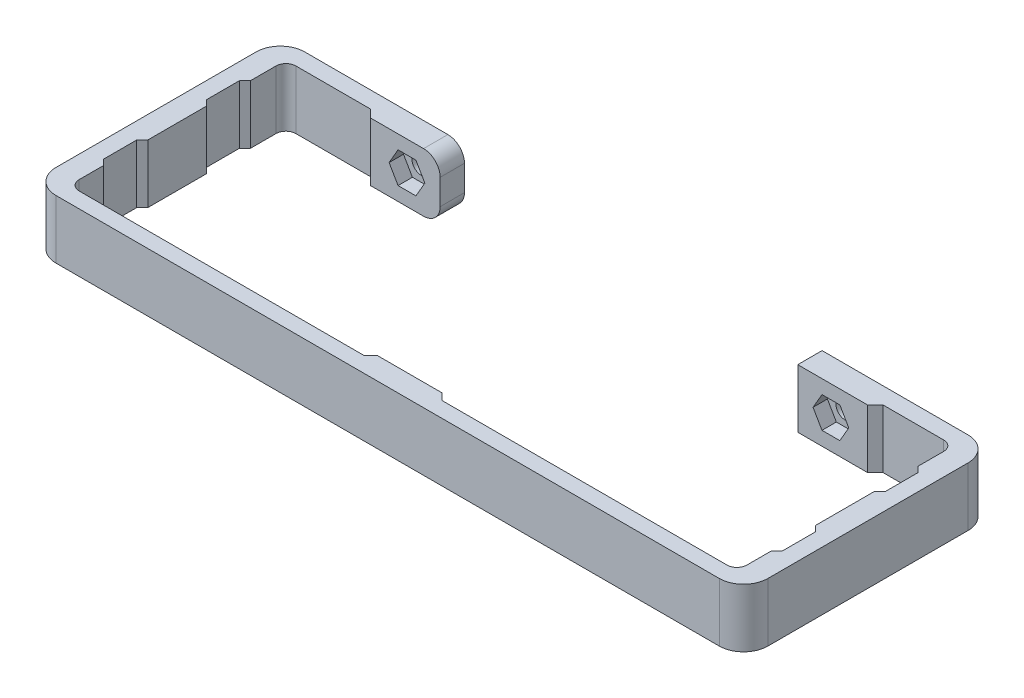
ISO-10303-21;
HEADER;
FILE_DESCRIPTION(('STEP AP214'),'2;1');
FILE_NAME('part.step','',(''),(''),'','','');
FILE_SCHEMA(('AUTOMOTIVE_DESIGN { 1 0 10303 214 1 1 1 1 }'));
ENDSEC;
DATA;
#1=APPLICATION_CONTEXT('core data for automotive mechanical design processes');
#2=APPLICATION_PROTOCOL_DEFINITION('international standard','automotive_design',2000,#1);
#3=PRODUCT_CONTEXT('',#1,'mechanical');
#4=PRODUCT('Part','Part','',(#3));
#5=PRODUCT_RELATED_PRODUCT_CATEGORY('part','',(#4));
#6=PRODUCT_DEFINITION_FORMATION('','',#4);
#7=PRODUCT_DEFINITION_CONTEXT('part definition',#1,'design');
#8=PRODUCT_DEFINITION('design','',#6,#7);
#9=PRODUCT_DEFINITION_SHAPE('','',#8);
#10=(LENGTH_UNIT() NAMED_UNIT(*) SI_UNIT(.MILLI.,.METRE.));
#11=(NAMED_UNIT(*) PLANE_ANGLE_UNIT() SI_UNIT($,.RADIAN.));
#12=(NAMED_UNIT(*) SI_UNIT($,.STERADIAN.) SOLID_ANGLE_UNIT());
#13=UNCERTAINTY_MEASURE_WITH_UNIT(LENGTH_MEASURE(1.E-05),#10,'distance_accuracy_value','');
#14=(GEOMETRIC_REPRESENTATION_CONTEXT(3) GLOBAL_UNCERTAINTY_ASSIGNED_CONTEXT((#13)) GLOBAL_UNIT_ASSIGNED_CONTEXT((#10,
#11,#12)) REPRESENTATION_CONTEXT('',''));
#15=CARTESIAN_POINT('',(0.,0.,0.));
#16=DIRECTION('',(0.,0.,1.));
#17=DIRECTION('',(1.,0.,0.));
#18=AXIS2_PLACEMENT_3D('',#15,#16,#17);
#19=CARTESIAN_POINT('',(117.397379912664,37.2165938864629,-41.));
#20=DIRECTION('',(1.,0.,0.));
#21=DIRECTION('',(0.,0.,-1.));
#22=AXIS2_PLACEMENT_3D('',#19,#20,#21);
#23=PLANE('',#22);
#24=DIRECTION('',(0.,0.,1.));
#25=VECTOR('',#24,1.);
#26=CARTESIAN_POINT('',(117.397379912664,47.8165938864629,-41.));
#27=LINE('',#26,#25);
#28=CARTESIAN_POINT('',(117.397379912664,47.8165938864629,-36.2));
#29=VERTEX_POINT('',#28);
#30=CARTESIAN_POINT('',(117.397379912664,47.8165938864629,-31.6));
#31=VERTEX_POINT('',#30);
#32=EDGE_CURVE('E561',#29,#31,#27,.T.);
#33=ORIENTED_EDGE('',*,*,#32,.F.);
#34=DIRECTION('',(0.,1.,0.));
#35=VECTOR('',#34,1.);
#36=CARTESIAN_POINT('',(117.397379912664,37.2165938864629,-36.2));
#37=LINE('',#36,#35);
#38=CARTESIAN_POINT('',(117.397379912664,37.2165938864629,-36.2));
#39=VERTEX_POINT('',#38);
#40=EDGE_CURVE('E768',#29,#39,#37,.F.);
#41=ORIENTED_EDGE('',*,*,#40,.T.);
#42=DIRECTION('',(0.,0.,1.));
#43=VECTOR('',#42,1.);
#44=CARTESIAN_POINT('',(117.397379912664,37.2165938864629,-41.));
#45=LINE('',#44,#43);
#46=CARTESIAN_POINT('',(117.397379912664,37.2165938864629,-31.6));
#47=VERTEX_POINT('',#46);
#48=EDGE_CURVE('E565',#39,#47,#45,.T.);
#49=ORIENTED_EDGE('',*,*,#48,.T.);
#50=DIRECTION('',(0.,-1.,0.));
#51=VECTOR('',#50,1.);
#52=CARTESIAN_POINT('',(117.397379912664,37.2165938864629,-31.6));
#53=LINE('',#52,#51);
#54=EDGE_CURVE('E667',#47,#31,#53,.F.);
#55=ORIENTED_EDGE('',*,*,#54,.T.);
#56=EDGE_LOOP('',(#33,#41,#49,#55));
#57=FACE_BOUND('',#56,.T.);
#58=ADVANCED_FACE('F33',(#57),#23,.F.);
#59=CARTESIAN_POINT('',(-3.40262008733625,37.2165938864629,-41.));
#60=DIRECTION('',(-1.,0.,0.));
#61=DIRECTION('',(0.,-1.,0.));
#62=AXIS2_PLACEMENT_3D('',#59,#60,#61);
#63=PLANE('',#62);
#64=DIRECTION('',(0.,0.,1.));
#65=VECTOR('',#64,1.);
#66=CARTESIAN_POINT('',(-3.40262008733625,47.8165938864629,-41.));
#67=LINE('',#66,#65);
#68=CARTESIAN_POINT('',(-3.40262008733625,47.8165938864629,-5.00000000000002));
#69=VERTEX_POINT('',#68);
#70=CARTESIAN_POINT('',(-3.40262008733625,47.8165938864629,-0.599999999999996));
#71=VERTEX_POINT('',#70);
#72=EDGE_CURVE('E550',#69,#71,#67,.T.);
#73=ORIENTED_EDGE('',*,*,#72,.T.);
#74=DIRECTION('',(0.,1.,0.));
#75=VECTOR('',#74,1.);
#76=CARTESIAN_POINT('',(-3.40262008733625,37.2165938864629,-0.6));
#77=LINE('',#76,#75);
#78=CARTESIAN_POINT('',(-3.40262008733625,37.2165938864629,-0.599999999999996));
#79=VERTEX_POINT('',#78);
#80=EDGE_CURVE('E783',#71,#79,#77,.F.);
#81=ORIENTED_EDGE('',*,*,#80,.T.);
#82=DIRECTION('',(0.,0.,1.));
#83=VECTOR('',#82,1.);
#84=CARTESIAN_POINT('',(-3.40262008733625,37.2165938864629,-41.));
#85=LINE('',#84,#83);
#86=CARTESIAN_POINT('',(-3.40262008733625,37.2165938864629,-5.00000000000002));
#87=VERTEX_POINT('',#86);
#88=EDGE_CURVE('E547',#87,#79,#85,.T.);
#89=ORIENTED_EDGE('',*,*,#88,.F.);
#90=DIRECTION('',(0.,-1.,0.));
#91=VECTOR('',#90,1.);
#92=CARTESIAN_POINT('',(-3.40262008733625,37.2165938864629,-5.00000000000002));
#93=LINE('',#92,#91);
#94=EDGE_CURVE('E724',#87,#69,#93,.F.);
#95=ORIENTED_EDGE('',*,*,#94,.T.);
#96=EDGE_LOOP('',(#73,#81,#89,#95));
#97=FACE_BOUND('',#96,.T.);
#98=ADVANCED_FACE('F843',(#97),#63,.F.);
#99=CARTESIAN_POINT('',(-3.40262008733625,47.8165938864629,-23.6));
#100=VERTEX_POINT('',#99);
#101=CARTESIAN_POINT('',(-3.40262008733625,47.8165938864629,-13.));
#102=VERTEX_POINT('',#101);
#103=EDGE_CURVE('E555',#100,#102,#67,.T.);
#104=ORIENTED_EDGE('',*,*,#103,.T.);
#105=DIRECTION('',(0.,1.,0.));
#106=VECTOR('',#105,1.);
#107=CARTESIAN_POINT('',(-3.40262008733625,37.2165938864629,-13.));
#108=LINE('',#107,#106);
#109=CARTESIAN_POINT('',(-3.40262008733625,37.2165938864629,-13.));
#110=VERTEX_POINT('',#109);
#111=EDGE_CURVE('E719',#102,#110,#108,.F.);
#112=ORIENTED_EDGE('',*,*,#111,.T.);
#113=CARTESIAN_POINT('',(-3.40262008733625,37.2165938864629,-23.6));
#114=VERTEX_POINT('',#113);
#115=EDGE_CURVE('E551',#114,#110,#85,.T.);
#116=ORIENTED_EDGE('',*,*,#115,.F.);
#117=DIRECTION('',(0.,-1.,0.));
#118=VECTOR('',#117,1.);
#119=CARTESIAN_POINT('',(-3.40262008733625,37.2165938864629,-23.6));
#120=LINE('',#119,#118);
#121=EDGE_CURVE('E732',#114,#100,#120,.F.);
#122=ORIENTED_EDGE('',*,*,#121,.T.);
#123=EDGE_LOOP('',(#104,#112,#116,#122));
#124=FACE_BOUND('',#123,.T.);
#125=ADVANCED_FACE('F851',(#124),#63,.F.);
#126=CARTESIAN_POINT('',(117.397379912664,47.8165938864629,-23.6));
#127=VERTEX_POINT('',#126);
#128=CARTESIAN_POINT('',(117.397379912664,47.8165938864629,-13.));
#129=VERTEX_POINT('',#128);
#130=EDGE_CURVE('E564',#127,#129,#27,.T.);
#131=ORIENTED_EDGE('',*,*,#130,.F.);
#132=DIRECTION('',(0.,1.,0.));
#133=VECTOR('',#132,1.);
#134=CARTESIAN_POINT('',(117.397379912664,37.2165938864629,-23.6));
#135=LINE('',#134,#133);
#136=CARTESIAN_POINT('',(117.397379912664,37.2165938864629,-23.6));
#137=VERTEX_POINT('',#136);
#138=EDGE_CURVE('E694',#127,#137,#135,.F.);
#139=ORIENTED_EDGE('',*,*,#138,.T.);
#140=CARTESIAN_POINT('',(117.397379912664,37.2165938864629,-13.));
#141=VERTEX_POINT('',#140);
#142=EDGE_CURVE('E568',#137,#141,#45,.T.);
#143=ORIENTED_EDGE('',*,*,#142,.T.);
#144=DIRECTION('',(0.,-1.,0.));
#145=VECTOR('',#144,1.);
#146=CARTESIAN_POINT('',(117.397379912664,37.2165938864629,-13.));
#147=LINE('',#146,#145);
#148=EDGE_CURVE('E683',#141,#129,#147,.F.);
#149=ORIENTED_EDGE('',*,*,#148,.T.);
#150=EDGE_LOOP('',(#131,#139,#143,#149));
#151=FACE_BOUND('',#150,.T.);
#152=ADVANCED_FACE('F846',(#151),#23,.F.);
#153=CARTESIAN_POINT('',(96.5973799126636,42.5165938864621,-30.4));
#154=DIRECTION('',(0.,0.,-1.));
#155=DIRECTION('',(-1.,0.,0.));
#156=AXIS2_PLACEMENT_3D('',#153,#154,#155);
#157=CYLINDRICAL_SURFACE('',#156,1.70000000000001);
#158=CARTESIAN_POINT('',(96.5973799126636,42.5165938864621,-41.));
#159=DIRECTION('',(0.,0.,-1.));
#160=DIRECTION('',(-1.,0.,0.));
#161=AXIS2_PLACEMENT_3D('',#158,#159,#160);
#162=CIRCLE('',#161,1.70000000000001);
#163=CARTESIAN_POINT('',(94.8973799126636,42.5165938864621,-41.));
#164=VERTEX_POINT('',#163);
#165=EDGE_CURVE('E512',#164,#164,#162,.T.);
#166=ORIENTED_EDGE('',*,*,#165,.T.);
#167=EDGE_LOOP('',(#166));
#168=FACE_BOUND('',#167,.T.);
#169=CARTESIAN_POINT('',(96.5973799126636,42.5165938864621,-39.2));
#170=DIRECTION('',(0.,0.,1.));
#171=DIRECTION('',(1.,0.,0.));
#172=AXIS2_PLACEMENT_3D('',#169,#170,#171);
#173=CIRCLE('',#172,1.70000000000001);
#174=CARTESIAN_POINT('',(98.2973799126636,42.5165938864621,-39.2));
#175=VERTEX_POINT('',#174);
#176=EDGE_CURVE('E455',#175,#175,#173,.F.);
#177=ORIENTED_EDGE('',*,*,#176,.F.);
#178=EDGE_LOOP('',(#177));
#179=FACE_BOUND('',#178,.T.);
#180=ADVANCED_FACE('F859',(#168,#179),#157,.F.);
#181=CARTESIAN_POINT('',(19.8973799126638,42.5165938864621,-30.4));
#182=DIRECTION('',(0.,0.,-1.));
#183=DIRECTION('',(-1.,0.,0.));
#184=AXIS2_PLACEMENT_3D('',#181,#182,#183);
#185=CYLINDRICAL_SURFACE('',#184,1.7);
#186=CARTESIAN_POINT('',(19.8973799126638,42.5165938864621,-41.));
#187=DIRECTION('',(0.,0.,-1.));
#188=DIRECTION('',(-1.,0.,0.));
#189=AXIS2_PLACEMENT_3D('',#186,#187,#188);
#190=CIRCLE('',#189,1.7);
#191=CARTESIAN_POINT('',(18.1973799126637,42.5165938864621,-41.));
#192=VERTEX_POINT('',#191);
#193=EDGE_CURVE('E515',#192,#192,#190,.T.);
#194=ORIENTED_EDGE('',*,*,#193,.T.);
#195=EDGE_LOOP('',(#194));
#196=FACE_BOUND('',#195,.T.);
#197=CARTESIAN_POINT('',(19.8973799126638,42.5165938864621,-39.2));
#198=DIRECTION('',(0.,0.,1.));
#199=DIRECTION('',(1.,0.,0.));
#200=AXIS2_PLACEMENT_3D('',#197,#198,#199);
#201=CIRCLE('',#200,1.7);
#202=CARTESIAN_POINT('',(21.5973799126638,42.5165938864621,-39.2));
#203=VERTEX_POINT('',#202);
#204=EDGE_CURVE('E501',#203,#203,#201,.F.);
#205=ORIENTED_EDGE('',*,*,#204,.F.);
#206=EDGE_LOOP('',(#205));
#207=FACE_BOUND('',#206,.T.);
#208=ADVANCED_FACE('F1012',(#196,#207),#185,.F.);
#209=CARTESIAN_POINT('',(0.,0.,0.));
#210=DIRECTION('',(0.,0.,1.));
#211=DIRECTION('',(1.,0.,0.));
#212=AXIS2_PLACEMENT_3D('',#209,#210,#211);
#213=PLANE('',#212);
#214=DIRECTION('',(1.,0.,0.));
#215=VECTOR('',#214,1.);
#216=CARTESIAN_POINT('',(-7.40262008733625,37.2165938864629,0.));
#217=LINE('',#216,#215);
#218=CARTESIAN_POINT('',(51.1973799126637,37.2165938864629,0.));
#219=VERTEX_POINT('',#218);
#220=CARTESIAN_POINT('',(62.7973799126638,37.2165938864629,0.));
#221=VERTEX_POINT('',#220);
#222=EDGE_CURVE('E567',#219,#221,#217,.T.);
#223=ORIENTED_EDGE('',*,*,#222,.F.);
#224=DIRECTION('',(0.,-1.,0.));
#225=VECTOR('',#224,1.);
#226=CARTESIAN_POINT('',(51.1973799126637,0.,0.));
#227=LINE('',#226,#225);
#228=CARTESIAN_POINT('',(51.1973799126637,47.8165938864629,0.));
#229=VERTEX_POINT('',#228);
#230=EDGE_CURVE('E707',#219,#229,#227,.F.);
#231=ORIENTED_EDGE('',*,*,#230,.T.);
#232=DIRECTION('',(-1.,0.,0.));
#233=VECTOR('',#232,1.);
#234=CARTESIAN_POINT('',(-7.40262008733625,47.8165938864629,0.));
#235=LINE('',#234,#233);
#236=CARTESIAN_POINT('',(62.7973799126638,47.8165938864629,0.));
#237=VERTEX_POINT('',#236);
#238=EDGE_CURVE('E573',#237,#229,#235,.T.);
#239=ORIENTED_EDGE('',*,*,#238,.F.);
#240=DIRECTION('',(0.,1.,0.));
#241=VECTOR('',#240,1.);
#242=CARTESIAN_POINT('',(62.7973799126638,0.,0.));
#243=LINE('',#242,#241);
#244=EDGE_CURVE('E702',#237,#221,#243,.F.);
#245=ORIENTED_EDGE('',*,*,#244,.T.);
#246=EDGE_LOOP('',(#223,#231,#239,#245));
#247=FACE_BOUND('',#246,.T.);
#248=ADVANCED_FACE('F1004',(#247),#213,.F.);
#249=CARTESIAN_POINT('',(-7.40262008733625,47.8165938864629,4.));
#250=DIRECTION('',(1.,0.,0.));
#251=DIRECTION('',(0.,1.,0.));
#252=AXIS2_PLACEMENT_3D('',#249,#250,#251);
#253=PLANE('',#252);
#254=DIRECTION('',(0.,0.,-1.));
#255=VECTOR('',#254,1.);
#256=CARTESIAN_POINT('',(-7.40262008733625,47.8165938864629,4.));
#257=LINE('',#256,#255);
#258=CARTESIAN_POINT('',(-7.40262008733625,47.8165938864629,-0.4));
#259=VERTEX_POINT('',#258);
#260=CARTESIAN_POINT('',(-7.40262008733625,47.8165938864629,-36.6));
#261=VERTEX_POINT('',#260);
#262=EDGE_CURVE('E576',#259,#261,#257,.T.);
#263=ORIENTED_EDGE('',*,*,#262,.T.);
#264=DIRECTION('',(0.,1.,0.));
#265=VECTOR('',#264,1.);
#266=CARTESIAN_POINT('',(-7.40262008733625,37.2165938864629,-36.6));
#267=LINE('',#266,#265);
#268=CARTESIAN_POINT('',(-7.40262008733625,37.2165938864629,-36.6));
#269=VERTEX_POINT('',#268);
#270=EDGE_CURVE('E619',#261,#269,#267,.F.);
#271=ORIENTED_EDGE('',*,*,#270,.T.);
#272=DIRECTION('',(0.,0.,-1.));
#273=VECTOR('',#272,1.);
#274=CARTESIAN_POINT('',(-7.40262008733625,37.2165938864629,4.));
#275=LINE('',#274,#273);
#276=CARTESIAN_POINT('',(-7.40262008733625,37.2165938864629,-0.4));
#277=VERTEX_POINT('',#276);
#278=EDGE_CURVE('E587',#277,#269,#275,.T.);
#279=ORIENTED_EDGE('',*,*,#278,.F.);
#280=DIRECTION('',(0.,-1.,0.));
#281=VECTOR('',#280,1.);
#282=CARTESIAN_POINT('',(-7.40262008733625,47.8165938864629,-0.4));
#283=LINE('',#282,#281);
#284=EDGE_CURVE('E617',#277,#259,#283,.F.);
#285=ORIENTED_EDGE('',*,*,#284,.T.);
#286=EDGE_LOOP('',(#263,#271,#279,#285));
#287=FACE_BOUND('',#286,.T.);
#288=ADVANCED_FACE('F1002',(#287),#253,.F.);
#289=CARTESIAN_POINT('',(-7.40262008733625,37.2165938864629,4.));
#290=DIRECTION('',(0.,1.,0.));
#291=DIRECTION('',(0.,0.,1.));
#292=AXIS2_PLACEMENT_3D('',#289,#290,#291);
#293=PLANE('',#292);
#294=DIRECTION('',(-1.,0.,0.));
#295=VECTOR('',#294,1.);
#296=CARTESIAN_POINT('',(-7.40262008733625,37.2165938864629,-41.));
#297=LINE('',#296,#295);
#298=CARTESIAN_POINT('',(22.8973799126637,37.2165938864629,-41.));
#299=VERTEX_POINT('',#298);
#300=CARTESIAN_POINT('',(-3.00262008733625,37.2165938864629,-41.));
#301=VERTEX_POINT('',#300);
#302=EDGE_CURVE('E545',#299,#301,#297,.T.);
#303=ORIENTED_EDGE('',*,*,#302,.F.);
#304=DIRECTION('',(0.,0.,-1.));
#305=VECTOR('',#304,1.);
#306=CARTESIAN_POINT('',(22.8973799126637,37.2165938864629,-36.6));
#307=LINE('',#306,#305);
#308=CARTESIAN_POINT('',(22.8973799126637,37.2165938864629,-36.6));
#309=VERTEX_POINT('',#308);
#310=EDGE_CURVE('E56',#299,#309,#307,.F.);
#311=ORIENTED_EDGE('',*,*,#310,.T.);
#312=DIRECTION('',(1.,0.,0.));
#313=VECTOR('',#312,1.);
#314=CARTESIAN_POINT('',(-3.40262008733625,37.2165938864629,-36.6));
#315=LINE('',#314,#313);
#316=CARTESIAN_POINT('',(13.2973799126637,37.2165938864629,-36.6));
#317=VERTEX_POINT('',#316);
#318=EDGE_CURVE('E534',#317,#309,#315,.T.);
#319=ORIENTED_EDGE('',*,*,#318,.F.);
#320=DIRECTION('',(0.707106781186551,0.,0.707106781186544));
#321=VECTOR('',#320,1.);
#322=CARTESIAN_POINT('',(23.2473799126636,37.2165938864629,-26.6500000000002));
#323=LINE('',#322,#321);
#324=CARTESIAN_POINT('',(11.8973799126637,37.2165938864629,-38.));
#325=VERTEX_POINT('',#324);
#326=EDGE_CURVE('E763',#317,#325,#323,.F.);
#327=ORIENTED_EDGE('',*,*,#326,.T.);
#328=DIRECTION('',(-1.,0.,0.));
#329=VECTOR('',#328,1.);
#330=CARTESIAN_POINT('',(-7.40262008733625,37.2165938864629,-38.));
#331=LINE('',#330,#329);
#332=CARTESIAN_POINT('',(-1.60262008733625,37.2165938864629,-38.));
#333=VERTEX_POINT('',#332);
#334=EDGE_CURVE('E958',#325,#333,#331,.T.);
#335=ORIENTED_EDGE('',*,*,#334,.T.);
#336=CARTESIAN_POINT('',(-1.60262008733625,37.2165938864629,-36.2));
#337=DIRECTION('',(0.,1.,0.));
#338=DIRECTION('',(0.,0.,1.));
#339=AXIS2_PLACEMENT_3D('',#336,#337,#338);
#340=CIRCLE('',#339,1.8);
#341=CARTESIAN_POINT('',(-3.40262008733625,37.2165938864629,-36.2));
#342=VERTEX_POINT('',#341);
#343=EDGE_CURVE('E795',#333,#342,#340,.T.);
#344=ORIENTED_EDGE('',*,*,#343,.T.);
#345=CARTESIAN_POINT('',(-3.40262008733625,37.2165938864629,-31.6));
#346=VERTEX_POINT('',#345);
#347=EDGE_CURVE('E548',#342,#346,#85,.T.);
#348=ORIENTED_EDGE('',*,*,#347,.T.);
#349=DIRECTION('',(0.707106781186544,0.,-0.707106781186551));
#350=VECTOR('',#349,1.);
#351=CARTESIAN_POINT('',(-23.2026200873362,37.2165938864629,-11.7999999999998));
#352=LINE('',#351,#350);
#353=CARTESIAN_POINT('',(-4.40262008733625,37.2165938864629,-30.6));
#354=VERTEX_POINT('',#353);
#355=EDGE_CURVE('E746',#346,#354,#352,.F.);
#356=ORIENTED_EDGE('',*,*,#355,.T.);
#357=DIRECTION('',(0.,0.,1.));
#358=VECTOR('',#357,1.);
#359=CARTESIAN_POINT('',(-4.40262008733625,37.2165938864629,4.));
#360=LINE('',#359,#358);
#361=CARTESIAN_POINT('',(-4.40262008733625,37.2165938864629,-24.6));
#362=VERTEX_POINT('',#361);
#363=EDGE_CURVE('E900',#354,#362,#360,.T.);
#364=ORIENTED_EDGE('',*,*,#363,.T.);
#365=DIRECTION('',(-0.707106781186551,0.,-0.707106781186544));
#366=VECTOR('',#365,1.);
#367=CARTESIAN_POINT('',(8.39737991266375,37.2165938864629,-11.8000000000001));
#368=LINE('',#367,#366);
#369=EDGE_CURVE('E737',#362,#114,#368,.F.);
#370=ORIENTED_EDGE('',*,*,#369,.T.);
#371=ORIENTED_EDGE('',*,*,#115,.T.);
#372=DIRECTION('',(0.707106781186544,0.,-0.707106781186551));
#373=VECTOR('',#372,1.);
#374=CARTESIAN_POINT('',(-13.9026200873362,37.2165938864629,-2.4999999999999));
#375=LINE('',#374,#373);
#376=CARTESIAN_POINT('',(-4.40262008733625,37.2165938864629,-12.));
#377=VERTEX_POINT('',#376);
#378=EDGE_CURVE('E722',#110,#377,#375,.F.);
#379=ORIENTED_EDGE('',*,*,#378,.T.);
#380=DIRECTION('',(0.,0.,1.));
#381=VECTOR('',#380,1.);
#382=CARTESIAN_POINT('',(-4.40262008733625,37.2165938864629,4.));
#383=LINE('',#382,#381);
#384=CARTESIAN_POINT('',(-4.40262008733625,37.2165938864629,-6.00000000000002));
#385=VERTEX_POINT('',#384);
#386=EDGE_CURVE('E908',#377,#385,#383,.T.);
#387=ORIENTED_EDGE('',*,*,#386,.T.);
#388=DIRECTION('',(-0.707106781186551,0.,-0.707106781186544));
#389=VECTOR('',#388,1.);
#390=CARTESIAN_POINT('',(-0.902620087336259,37.2165938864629,-2.50000000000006));
#391=LINE('',#390,#389);
#392=EDGE_CURVE('E729',#385,#87,#391,.F.);
#393=ORIENTED_EDGE('',*,*,#392,.T.);
#394=ORIENTED_EDGE('',*,*,#88,.T.);
#395=CARTESIAN_POINT('',(-1.60262008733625,37.2165938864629,-0.6));
#396=DIRECTION('',(0.,1.,0.));
#397=DIRECTION('',(0.,0.,1.));
#398=AXIS2_PLACEMENT_3D('',#395,#396,#397);
#399=CIRCLE('',#398,1.8);
#400=CARTESIAN_POINT('',(-1.60262008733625,37.2165938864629,1.2));
#401=VERTEX_POINT('',#400);
#402=EDGE_CURVE('E799',#79,#401,#399,.T.);
#403=ORIENTED_EDGE('',*,*,#402,.T.);
#404=DIRECTION('',(1.,0.,0.));
#405=VECTOR('',#404,1.);
#406=CARTESIAN_POINT('',(-7.40262008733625,37.2165938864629,1.2));
#407=LINE('',#406,#405);
#408=CARTESIAN_POINT('',(49.9973799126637,37.2165938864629,1.2));
#409=VERTEX_POINT('',#408);
#410=EDGE_CURVE('E889',#401,#409,#407,.T.);
#411=ORIENTED_EDGE('',*,*,#410,.T.);
#412=DIRECTION('',(-0.707106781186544,0.,0.707106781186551));
#413=VECTOR('',#412,1.);
#414=CARTESIAN_POINT('',(19.897379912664,37.2165938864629,31.3));
#415=LINE('',#414,#413);
#416=EDGE_CURVE('E713',#409,#219,#415,.F.);
#417=ORIENTED_EDGE('',*,*,#416,.T.);
#418=ORIENTED_EDGE('',*,*,#222,.T.);
#419=DIRECTION('',(-0.707106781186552,0.,-0.707106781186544));
#420=VECTOR('',#419,1.);
#421=CARTESIAN_POINT('',(29.6973799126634,37.2165938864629,-33.1));
#422=LINE('',#421,#420);
#423=CARTESIAN_POINT('',(63.9973799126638,37.2165938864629,1.20000000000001));
#424=VERTEX_POINT('',#423);
#425=EDGE_CURVE('E705',#221,#424,#422,.F.);
#426=ORIENTED_EDGE('',*,*,#425,.T.);
#427=DIRECTION('',(1.,0.,0.));
#428=VECTOR('',#427,1.);
#429=CARTESIAN_POINT('',(-7.40262008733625,37.2165938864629,1.20000000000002));
#430=LINE('',#429,#428);
#431=CARTESIAN_POINT('',(115.597379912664,37.2165938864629,1.2));
#432=VERTEX_POINT('',#431);
#433=EDGE_CURVE('E888',#424,#432,#430,.T.);
#434=ORIENTED_EDGE('',*,*,#433,.T.);
#435=CARTESIAN_POINT('',(115.597379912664,37.2165938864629,-0.599999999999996));
#436=DIRECTION('',(0.,1.,0.));
#437=DIRECTION('',(0.,0.,1.));
#438=AXIS2_PLACEMENT_3D('',#435,#436,#437);
#439=CIRCLE('',#438,1.8);
#440=CARTESIAN_POINT('',(117.397379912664,37.2165938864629,-0.599999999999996));
#441=VERTEX_POINT('',#440);
#442=EDGE_CURVE('E791',#432,#441,#439,.T.);
#443=ORIENTED_EDGE('',*,*,#442,.T.);
#444=CARTESIAN_POINT('',(117.397379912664,37.2165938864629,-5.00000000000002));
#445=VERTEX_POINT('',#444);
#446=EDGE_CURVE('E563',#445,#441,#45,.T.);
#447=ORIENTED_EDGE('',*,*,#446,.F.);
#448=DIRECTION('',(-0.707106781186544,0.,0.707106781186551));
#449=VECTOR('',#448,1.);
#450=CARTESIAN_POINT('',(50.4973799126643,37.2165938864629,61.9));
#451=LINE('',#450,#449);
#452=CARTESIAN_POINT('',(118.397379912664,37.2165938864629,-6.00000000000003));
#453=VERTEX_POINT('',#452);
#454=EDGE_CURVE('E681',#445,#453,#451,.F.);
#455=ORIENTED_EDGE('',*,*,#454,.T.);
#456=DIRECTION('',(0.,0.,-1.));
#457=VECTOR('',#456,1.);
#458=CARTESIAN_POINT('',(118.397379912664,37.2165938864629,4.));
#459=LINE('',#458,#457);
#460=CARTESIAN_POINT('',(118.397379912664,37.2165938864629,-12.));
#461=VERTEX_POINT('',#460);
#462=EDGE_CURVE('E432',#453,#461,#459,.T.);
#463=ORIENTED_EDGE('',*,*,#462,.T.);
#464=DIRECTION('',(0.70710678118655,0.,0.707106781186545));
#465=VECTOR('',#464,1.);
#466=CARTESIAN_POINT('',(63.4973799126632,37.2165938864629,-66.9000000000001));
#467=LINE('',#466,#465);
#468=EDGE_CURVE('E688',#461,#141,#467,.F.);
#469=ORIENTED_EDGE('',*,*,#468,.T.);
#470=ORIENTED_EDGE('',*,*,#142,.F.);
#471=DIRECTION('',(-0.707106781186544,0.,0.707106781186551));
#472=VECTOR('',#471,1.);
#473=CARTESIAN_POINT('',(41.1973799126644,37.2165938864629,52.6000000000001));
#474=LINE('',#473,#472);
#475=CARTESIAN_POINT('',(118.397379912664,37.2165938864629,-24.6));
#476=VERTEX_POINT('',#475);
#477=EDGE_CURVE('E697',#137,#476,#474,.F.);
#478=ORIENTED_EDGE('',*,*,#477,.T.);
#479=DIRECTION('',(0.,0.,-1.));
#480=VECTOR('',#479,1.);
#481=CARTESIAN_POINT('',(118.397379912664,37.2165938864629,4.));
#482=LINE('',#481,#480);
#483=CARTESIAN_POINT('',(118.397379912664,37.2165938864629,-30.6));
#484=VERTEX_POINT('',#483);
#485=EDGE_CURVE('E911',#476,#484,#482,.T.);
#486=ORIENTED_EDGE('',*,*,#485,.T.);
#487=DIRECTION('',(0.70710678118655,0.,0.707106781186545));
#488=VECTOR('',#487,1.);
#489=CARTESIAN_POINT('',(72.7973799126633,37.2165938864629,-76.2000000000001));
#490=LINE('',#489,#488);
#491=EDGE_CURVE('E672',#484,#47,#490,.F.);
#492=ORIENTED_EDGE('',*,*,#491,.T.);
#493=ORIENTED_EDGE('',*,*,#48,.F.);
#494=CARTESIAN_POINT('',(115.597379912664,37.2165938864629,-36.2));
#495=DIRECTION('',(0.,1.,0.));
#496=DIRECTION('',(0.,0.,1.));
#497=AXIS2_PLACEMENT_3D('',#494,#495,#496);
#498=CIRCLE('',#497,1.8);
#499=CARTESIAN_POINT('',(115.597379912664,37.2165938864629,-38.));
#500=VERTEX_POINT('',#499);
#501=EDGE_CURVE('E787',#39,#500,#498,.T.);
#502=ORIENTED_EDGE('',*,*,#501,.T.);
#503=DIRECTION('',(-1.,0.,0.));
#504=VECTOR('',#503,1.);
#505=CARTESIAN_POINT('',(-7.40262008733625,37.2165938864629,-38.));
#506=LINE('',#505,#504);
#507=CARTESIAN_POINT('',(104.597379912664,37.2165938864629,-38.));
#508=VERTEX_POINT('',#507);
#509=EDGE_CURVE('E893',#500,#508,#506,.T.);
#510=ORIENTED_EDGE('',*,*,#509,.T.);
#511=DIRECTION('',(0.707106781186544,0.,-0.707106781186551));
#512=VECTOR('',#511,1.);
#513=CARTESIAN_POINT('',(27.5973799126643,37.2165938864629,39.0000000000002));
#514=LINE('',#513,#512);
#515=CARTESIAN_POINT('',(103.197379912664,37.2165938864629,-36.6));
#516=VERTEX_POINT('',#515);
#517=EDGE_CURVE('E754',#508,#516,#514,.F.);
#518=ORIENTED_EDGE('',*,*,#517,.T.);
#519=DIRECTION('',(1.,0.,0.));
#520=VECTOR('',#519,1.);
#521=CARTESIAN_POINT('',(117.397379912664,37.2165938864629,-36.6));
#522=LINE('',#521,#520);
#523=CARTESIAN_POINT('',(90.5973799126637,37.2165938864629,-36.6));
#524=VERTEX_POINT('',#523);
#525=EDGE_CURVE('E522',#524,#516,#522,.T.);
#526=ORIENTED_EDGE('',*,*,#525,.F.);
#527=DIRECTION('',(0.,0.,1.));
#528=VECTOR('',#527,1.);
#529=CARTESIAN_POINT('',(90.5973799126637,37.2165938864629,-41.));
#530=LINE('',#529,#528);
#531=CARTESIAN_POINT('',(90.5973799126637,37.2165938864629,-41.));
#532=VERTEX_POINT('',#531);
#533=EDGE_CURVE('E519',#532,#524,#530,.T.);
#534=ORIENTED_EDGE('',*,*,#533,.F.);
#535=DIRECTION('',(-1.,0.,0.));
#536=VECTOR('',#535,1.);
#537=CARTESIAN_POINT('',(121.397379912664,37.2165938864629,-41.));
#538=LINE('',#537,#536);
#539=CARTESIAN_POINT('',(116.997379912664,37.2165938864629,-41.));
#540=VERTEX_POINT('',#539);
#541=EDGE_CURVE('E554',#540,#532,#538,.T.);
#542=ORIENTED_EDGE('',*,*,#541,.F.);
#543=CARTESIAN_POINT('',(116.997379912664,37.2165938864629,-36.6));
#544=DIRECTION('',(0.,1.,0.));
#545=DIRECTION('',(0.,0.,1.));
#546=AXIS2_PLACEMENT_3D('',#543,#544,#545);
#547=CIRCLE('',#546,4.4);
#548=CARTESIAN_POINT('',(121.397379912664,37.2165938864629,-36.6));
#549=VERTEX_POINT('',#548);
#550=EDGE_CURVE('E600',#540,#549,#547,.F.);
#551=ORIENTED_EDGE('',*,*,#550,.T.);
#552=DIRECTION('',(0.,0.,-1.));
#553=VECTOR('',#552,1.);
#554=CARTESIAN_POINT('',(121.397379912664,37.2165938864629,4.));
#555=LINE('',#554,#553);
#556=CARTESIAN_POINT('',(121.397379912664,37.2165938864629,-0.4));
#557=VERTEX_POINT('',#556);
#558=EDGE_CURVE('E584',#557,#549,#555,.T.);
#559=ORIENTED_EDGE('',*,*,#558,.F.);
#560=CARTESIAN_POINT('',(116.997379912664,37.2165938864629,-0.4));
#561=DIRECTION('',(0.,1.,0.));
#562=DIRECTION('',(0.,0.,1.));
#563=AXIS2_PLACEMENT_3D('',#560,#561,#562);
#564=CIRCLE('',#563,4.4);
#565=CARTESIAN_POINT('',(116.997379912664,37.2165938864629,4.));
#566=VERTEX_POINT('',#565);
#567=EDGE_CURVE('E593',#557,#566,#564,.F.);
#568=ORIENTED_EDGE('',*,*,#567,.T.);
#569=DIRECTION('',(1.,0.,0.));
#570=VECTOR('',#569,1.);
#571=CARTESIAN_POINT('',(-7.40262008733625,37.2165938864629,4.));
#572=LINE('',#571,#570);
#573=CARTESIAN_POINT('',(-3.00262008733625,37.2165938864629,4.));
#574=VERTEX_POINT('',#573);
#575=EDGE_CURVE('E569',#574,#566,#572,.T.);
#576=ORIENTED_EDGE('',*,*,#575,.F.);
#577=CARTESIAN_POINT('',(-3.00262008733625,37.2165938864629,-0.4));
#578=DIRECTION('',(0.,1.,0.));
#579=DIRECTION('',(0.,0.,1.));
#580=AXIS2_PLACEMENT_3D('',#577,#578,#579);
#581=CIRCLE('',#580,4.4);
#582=EDGE_CURVE('E595',#574,#277,#581,.F.);
#583=ORIENTED_EDGE('',*,*,#582,.T.);
#584=ORIENTED_EDGE('',*,*,#278,.T.);
#585=CARTESIAN_POINT('',(-3.00262008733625,37.2165938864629,-36.6));
#586=DIRECTION('',(0.,1.,0.));
#587=DIRECTION('',(0.,0.,1.));
#588=AXIS2_PLACEMENT_3D('',#585,#586,#587);
#589=CIRCLE('',#588,4.4);
#590=EDGE_CURVE('E597',#269,#301,#589,.F.);
#591=ORIENTED_EDGE('',*,*,#590,.T.);
#592=EDGE_LOOP('',(#303,#311,#319,#327,#335,#344,#348,#356,#364,#370,#371,#379,#387,#393,#394,
#403,#411,#417,#418,#426,#434,#443,#447,#455,#463,#469,#470,#478,#486,#492,#493,#502,#510,#518,
#526,#534,#542,#551,#559,#568,#576,#583,#584,#591));
#593=FACE_BOUND('',#592,.T.);
#594=ADVANCED_FACE('F824',(#593),#293,.F.);
#595=CARTESIAN_POINT('',(121.397379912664,47.8165938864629,4.));
#596=DIRECTION('',(-1.,0.,0.));
#597=DIRECTION('',(0.,0.,1.));
#598=AXIS2_PLACEMENT_3D('',#595,#596,#597);
#599=PLANE('',#598);
#600=ORIENTED_EDGE('',*,*,#558,.T.);
#601=DIRECTION('',(0.,-1.,0.));
#602=VECTOR('',#601,1.);
#603=CARTESIAN_POINT('',(121.397379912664,47.8165938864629,-36.6));
#604=LINE('',#603,#602);
#605=CARTESIAN_POINT('',(121.397379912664,47.8165938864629,-36.6));
#606=VERTEX_POINT('',#605);
#607=EDGE_CURVE('E604',#549,#606,#604,.F.);
#608=ORIENTED_EDGE('',*,*,#607,.T.);
#609=DIRECTION('',(0.,0.,-1.));
#610=VECTOR('',#609,1.);
#611=CARTESIAN_POINT('',(121.397379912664,47.8165938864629,4.));
#612=LINE('',#611,#610);
#613=CARTESIAN_POINT('',(121.397379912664,47.8165938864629,-0.4));
#614=VERTEX_POINT('',#613);
#615=EDGE_CURVE('E581',#614,#606,#612,.T.);
#616=ORIENTED_EDGE('',*,*,#615,.F.);
#617=DIRECTION('',(0.,1.,0.));
#618=VECTOR('',#617,1.);
#619=CARTESIAN_POINT('',(121.397379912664,37.2165938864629,-0.4));
#620=LINE('',#619,#618);
#621=EDGE_CURVE('E602',#614,#557,#620,.F.);
#622=ORIENTED_EDGE('',*,*,#621,.T.);
#623=EDGE_LOOP('',(#600,#608,#616,#622));
#624=FACE_BOUND('',#623,.T.);
#625=ADVANCED_FACE('F988',(#624),#599,.F.);
#626=CARTESIAN_POINT('',(-7.40262008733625,47.8165938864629,4.));
#627=DIRECTION('',(0.,-1.,0.));
#628=DIRECTION('',(0.,0.,-1.));
#629=AXIS2_PLACEMENT_3D('',#626,#627,#628);
#630=PLANE('',#629);
#631=DIRECTION('',(1.,0.,0.));
#632=VECTOR('',#631,1.);
#633=CARTESIAN_POINT('',(-3.40262008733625,47.8165938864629,-36.6));
#634=LINE('',#633,#632);
#635=CARTESIAN_POINT('',(13.2973799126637,47.8165938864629,-36.6));
#636=VERTEX_POINT('',#635);
#637=CARTESIAN_POINT('',(22.8973799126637,47.8165938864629,-36.6));
#638=VERTEX_POINT('',#637);
#639=EDGE_CURVE('E531',#636,#638,#634,.T.);
#640=ORIENTED_EDGE('',*,*,#639,.T.);
#641=DIRECTION('',(0.,0.,-1.));
#642=VECTOR('',#641,1.);
#643=CARTESIAN_POINT('',(22.8973799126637,47.8165938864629,-41.));
#644=LINE('',#643,#642);
#645=CARTESIAN_POINT('',(22.8973799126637,47.8165938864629,-41.));
#646=VERTEX_POINT('',#645);
#647=EDGE_CURVE('E11',#638,#646,#644,.T.);
#648=ORIENTED_EDGE('',*,*,#647,.T.);
#649=DIRECTION('',(1.,0.,0.));
#650=VECTOR('',#649,1.);
#651=CARTESIAN_POINT('',(-7.40262008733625,47.8165938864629,-41.));
#652=LINE('',#651,#650);
#653=CARTESIAN_POINT('',(-3.00262008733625,47.8165938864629,-41.));
#654=VERTEX_POINT('',#653);
#655=EDGE_CURVE('E541',#654,#646,#652,.T.);
#656=ORIENTED_EDGE('',*,*,#655,.F.);
#657=CARTESIAN_POINT('',(-3.00262008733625,47.8165938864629,-36.6));
#658=DIRECTION('',(0.,-1.,0.));
#659=DIRECTION('',(0.,0.,-1.));
#660=AXIS2_PLACEMENT_3D('',#657,#658,#659);
#661=CIRCLE('',#660,4.4);
#662=EDGE_CURVE('E610',#654,#261,#661,.F.);
#663=ORIENTED_EDGE('',*,*,#662,.T.);
#664=ORIENTED_EDGE('',*,*,#262,.F.);
#665=CARTESIAN_POINT('',(-3.00262008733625,47.8165938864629,-0.4));
#666=DIRECTION('',(0.,-1.,0.));
#667=DIRECTION('',(0.,0.,-1.));
#668=AXIS2_PLACEMENT_3D('',#665,#666,#667);
#669=CIRCLE('',#668,4.4);
#670=CARTESIAN_POINT('',(-3.00262008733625,47.8165938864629,4.));
#671=VERTEX_POINT('',#670);
#672=EDGE_CURVE('E608',#259,#671,#669,.F.);
#673=ORIENTED_EDGE('',*,*,#672,.T.);
#674=DIRECTION('',(-1.,0.,0.));
#675=VECTOR('',#674,1.);
#676=CARTESIAN_POINT('',(-7.40262008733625,47.8165938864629,4.));
#677=LINE('',#676,#675);
#678=CARTESIAN_POINT('',(116.997379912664,47.8165938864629,4.));
#679=VERTEX_POINT('',#678);
#680=EDGE_CURVE('E572',#679,#671,#677,.T.);
#681=ORIENTED_EDGE('',*,*,#680,.F.);
#682=CARTESIAN_POINT('',(116.997379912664,47.8165938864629,-0.4));
#683=DIRECTION('',(0.,-1.,0.));
#684=DIRECTION('',(0.,0.,-1.));
#685=AXIS2_PLACEMENT_3D('',#682,#683,#684);
#686=CIRCLE('',#685,4.4);
#687=EDGE_CURVE('E606',#679,#614,#686,.F.);
#688=ORIENTED_EDGE('',*,*,#687,.T.);
#689=ORIENTED_EDGE('',*,*,#615,.T.);
#690=CARTESIAN_POINT('',(116.997379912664,47.8165938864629,-36.6));
#691=DIRECTION('',(0.,-1.,0.));
#692=DIRECTION('',(0.,0.,-1.));
#693=AXIS2_PLACEMENT_3D('',#690,#691,#692);
#694=CIRCLE('',#693,4.4);
#695=CARTESIAN_POINT('',(116.997379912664,47.8165938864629,-41.));
#696=VERTEX_POINT('',#695);
#697=EDGE_CURVE('E612',#606,#696,#694,.F.);
#698=ORIENTED_EDGE('',*,*,#697,.T.);
#699=DIRECTION('',(1.,0.,0.));
#700=VECTOR('',#699,1.);
#701=CARTESIAN_POINT('',(121.397379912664,47.8165938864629,-41.));
#702=LINE('',#701,#700);
#703=CARTESIAN_POINT('',(90.5973799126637,47.8165938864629,-41.));
#704=VERTEX_POINT('',#703);
#705=EDGE_CURVE('E557',#704,#696,#702,.T.);
#706=ORIENTED_EDGE('',*,*,#705,.F.);
#707=DIRECTION('',(0.,0.,1.));
#708=VECTOR('',#707,1.);
#709=CARTESIAN_POINT('',(90.5973799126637,47.8165938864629,-41.));
#710=LINE('',#709,#708);
#711=CARTESIAN_POINT('',(90.5973799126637,47.8165938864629,-36.6));
#712=VERTEX_POINT('',#711);
#713=EDGE_CURVE('E518',#704,#712,#710,.T.);
#714=ORIENTED_EDGE('',*,*,#713,.T.);
#715=DIRECTION('',(1.,0.,0.));
#716=VECTOR('',#715,1.);
#717=CARTESIAN_POINT('',(117.397379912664,47.8165938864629,-36.6));
#718=LINE('',#717,#716);
#719=CARTESIAN_POINT('',(103.197379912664,47.8165938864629,-36.6));
#720=VERTEX_POINT('',#719);
#721=EDGE_CURVE('E523',#712,#720,#718,.T.);
#722=ORIENTED_EDGE('',*,*,#721,.T.);
#723=DIRECTION('',(-0.707106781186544,0.,0.707106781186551));
#724=VECTOR('',#723,1.);
#725=CARTESIAN_POINT('',(27.5973799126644,47.8165938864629,39.0000000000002));
#726=LINE('',#725,#724);
#727=CARTESIAN_POINT('',(104.597379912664,47.8165938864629,-38.));
#728=VERTEX_POINT('',#727);
#729=EDGE_CURVE('E751',#720,#728,#726,.F.);
#730=ORIENTED_EDGE('',*,*,#729,.T.);
#731=DIRECTION('',(-1.,0.,0.));
#732=VECTOR('',#731,1.);
#733=CARTESIAN_POINT('',(117.397379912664,47.8165938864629,-38.));
#734=LINE('',#733,#732);
#735=CARTESIAN_POINT('',(115.597379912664,47.8165938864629,-38.));
#736=VERTEX_POINT('',#735);
#737=EDGE_CURVE('E952',#736,#728,#734,.T.);
#738=ORIENTED_EDGE('',*,*,#737,.F.);
#739=CARTESIAN_POINT('',(115.597379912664,47.8165938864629,-36.2));
#740=DIRECTION('',(0.,-1.,0.));
#741=DIRECTION('',(0.,0.,-1.));
#742=AXIS2_PLACEMENT_3D('',#739,#740,#741);
#743=CIRCLE('',#742,1.8);
#744=EDGE_CURVE('E785',#736,#29,#743,.T.);
#745=ORIENTED_EDGE('',*,*,#744,.T.);
#746=ORIENTED_EDGE('',*,*,#32,.T.);
#747=DIRECTION('',(-0.70710678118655,0.,-0.707106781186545));
#748=VECTOR('',#747,1.);
#749=CARTESIAN_POINT('',(72.7973799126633,47.8165938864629,-76.2000000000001));
#750=LINE('',#749,#748);
#751=CARTESIAN_POINT('',(118.397379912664,47.8165938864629,-30.6));
#752=VERTEX_POINT('',#751);
#753=EDGE_CURVE('E670',#31,#752,#750,.F.);
#754=ORIENTED_EDGE('',*,*,#753,.T.);
#755=DIRECTION('',(0.,0.,-1.));
#756=VECTOR('',#755,1.);
#757=CARTESIAN_POINT('',(118.397379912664,47.8165938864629,-32.6));
#758=LINE('',#757,#756);
#759=CARTESIAN_POINT('',(118.397379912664,47.8165938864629,-24.6));
#760=VERTEX_POINT('',#759);
#761=EDGE_CURVE('E897',#760,#752,#758,.T.);
#762=ORIENTED_EDGE('',*,*,#761,.F.);
#763=DIRECTION('',(0.707106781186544,0.,-0.707106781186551));
#764=VECTOR('',#763,1.);
#765=CARTESIAN_POINT('',(41.1973799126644,47.8165938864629,52.6000000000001));
#766=LINE('',#765,#764);
#767=EDGE_CURVE('E691',#760,#127,#766,.F.);
#768=ORIENTED_EDGE('',*,*,#767,.T.);
#769=ORIENTED_EDGE('',*,*,#130,.T.);
#770=DIRECTION('',(-0.70710678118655,0.,-0.707106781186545));
#771=VECTOR('',#770,1.);
#772=CARTESIAN_POINT('',(63.4973799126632,47.8165938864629,-66.9000000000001));
#773=LINE('',#772,#771);
#774=CARTESIAN_POINT('',(118.397379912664,47.8165938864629,-12.));
#775=VERTEX_POINT('',#774);
#776=EDGE_CURVE('E686',#129,#775,#773,.F.);
#777=ORIENTED_EDGE('',*,*,#776,.T.);
#778=DIRECTION('',(0.,0.,-1.));
#779=VECTOR('',#778,1.);
#780=CARTESIAN_POINT('',(118.397379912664,47.8165938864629,-4.));
#781=LINE('',#780,#779);
#782=CARTESIAN_POINT('',(118.397379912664,47.8165938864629,-6.00000000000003));
#783=VERTEX_POINT('',#782);
#784=EDGE_CURVE('E913',#783,#775,#781,.T.);
#785=ORIENTED_EDGE('',*,*,#784,.F.);
#786=DIRECTION('',(0.707106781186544,0.,-0.707106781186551));
#787=VECTOR('',#786,1.);
#788=CARTESIAN_POINT('',(50.4973799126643,47.8165938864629,61.9));
#789=LINE('',#788,#787);
#790=CARTESIAN_POINT('',(117.397379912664,47.8165938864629,-5.00000000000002));
#791=VERTEX_POINT('',#790);
#792=EDGE_CURVE('E675',#783,#791,#789,.F.);
#793=ORIENTED_EDGE('',*,*,#792,.T.);
#794=CARTESIAN_POINT('',(117.397379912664,47.8165938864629,-0.599999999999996));
#795=VERTEX_POINT('',#794);
#796=EDGE_CURVE('E560',#791,#795,#27,.T.);
#797=ORIENTED_EDGE('',*,*,#796,.T.);
#798=CARTESIAN_POINT('',(115.597379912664,47.8165938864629,-0.599999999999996));
#799=DIRECTION('',(0.,-1.,0.));
#800=DIRECTION('',(0.,0.,-1.));
#801=AXIS2_PLACEMENT_3D('',#798,#799,#800);
#802=CIRCLE('',#801,1.8);
#803=CARTESIAN_POINT('',(115.597379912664,47.8165938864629,1.2));
#804=VERTEX_POINT('',#803);
#805=EDGE_CURVE('E789',#795,#804,#802,.T.);
#806=ORIENTED_EDGE('',*,*,#805,.T.);
#807=DIRECTION('',(1.,0.,0.));
#808=VECTOR('',#807,1.);
#809=CARTESIAN_POINT('',(117.397379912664,47.8165938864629,1.2));
#810=LINE('',#809,#808);
#811=CARTESIAN_POINT('',(63.9973799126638,47.8165938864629,1.20000000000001));
#812=VERTEX_POINT('',#811);
#813=EDGE_CURVE('E882',#812,#804,#810,.T.);
#814=ORIENTED_EDGE('',*,*,#813,.F.);
#815=DIRECTION('',(0.707106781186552,0.,0.707106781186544));
#816=VECTOR('',#815,1.);
#817=CARTESIAN_POINT('',(29.6973799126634,47.8165938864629,-33.1));
#818=LINE('',#817,#816);
#819=EDGE_CURVE('E699',#812,#237,#818,.F.);
#820=ORIENTED_EDGE('',*,*,#819,.T.);
#821=ORIENTED_EDGE('',*,*,#238,.T.);
#822=DIRECTION('',(0.707106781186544,0.,-0.707106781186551));
#823=VECTOR('',#822,1.);
#824=CARTESIAN_POINT('',(19.897379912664,47.8165938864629,31.3));
#825=LINE('',#824,#823);
#826=CARTESIAN_POINT('',(49.9973799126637,47.8165938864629,1.2));
#827=VERTEX_POINT('',#826);
#828=EDGE_CURVE('E710',#229,#827,#825,.F.);
#829=ORIENTED_EDGE('',*,*,#828,.T.);
#830=DIRECTION('',(1.,0.,0.));
#831=VECTOR('',#830,1.);
#832=CARTESIAN_POINT('',(-3.40262008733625,47.8165938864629,1.2));
#833=LINE('',#832,#831);
#834=CARTESIAN_POINT('',(-1.60262008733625,47.8165938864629,1.2));
#835=VERTEX_POINT('',#834);
#836=EDGE_CURVE('E955',#835,#827,#833,.T.);
#837=ORIENTED_EDGE('',*,*,#836,.F.);
#838=CARTESIAN_POINT('',(-1.60262008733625,47.8165938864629,-0.6));
#839=DIRECTION('',(0.,-1.,0.));
#840=DIRECTION('',(0.,0.,-1.));
#841=AXIS2_PLACEMENT_3D('',#838,#839,#840);
#842=CIRCLE('',#841,1.8);
#843=EDGE_CURVE('E797',#835,#71,#842,.T.);
#844=ORIENTED_EDGE('',*,*,#843,.T.);
#845=ORIENTED_EDGE('',*,*,#72,.F.);
#846=DIRECTION('',(0.707106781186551,0.,0.707106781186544));
#847=VECTOR('',#846,1.);
#848=CARTESIAN_POINT('',(-0.902620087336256,47.8165938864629,-2.50000000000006));
#849=LINE('',#848,#847);
#850=CARTESIAN_POINT('',(-4.40262008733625,47.8165938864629,-6.00000000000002));
#851=VERTEX_POINT('',#850);
#852=EDGE_CURVE('E727',#69,#851,#849,.F.);
#853=ORIENTED_EDGE('',*,*,#852,.T.);
#854=DIRECTION('',(0.,0.,1.));
#855=VECTOR('',#854,1.);
#856=CARTESIAN_POINT('',(-4.40262008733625,47.8165938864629,-4.));
#857=LINE('',#856,#855);
#858=CARTESIAN_POINT('',(-4.40262008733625,47.8165938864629,-12.));
#859=VERTEX_POINT('',#858);
#860=EDGE_CURVE('E901',#859,#851,#857,.T.);
#861=ORIENTED_EDGE('',*,*,#860,.F.);
#862=DIRECTION('',(-0.707106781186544,0.,0.707106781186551));
#863=VECTOR('',#862,1.);
#864=CARTESIAN_POINT('',(-13.9026200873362,47.8165938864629,-2.4999999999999));
#865=LINE('',#864,#863);
#866=EDGE_CURVE('E716',#859,#102,#865,.F.);
#867=ORIENTED_EDGE('',*,*,#866,.T.);
#868=ORIENTED_EDGE('',*,*,#103,.F.);
#869=DIRECTION('',(0.707106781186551,0.,0.707106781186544));
#870=VECTOR('',#869,1.);
#871=CARTESIAN_POINT('',(8.39737991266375,47.8165938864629,-11.8000000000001));
#872=LINE('',#871,#870);
#873=CARTESIAN_POINT('',(-4.40262008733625,47.8165938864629,-24.6));
#874=VERTEX_POINT('',#873);
#875=EDGE_CURVE('E735',#100,#874,#872,.F.);
#876=ORIENTED_EDGE('',*,*,#875,.T.);
#877=DIRECTION('',(0.,0.,1.));
#878=VECTOR('',#877,1.);
#879=CARTESIAN_POINT('',(-4.40262008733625,47.8165938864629,-32.6));
#880=LINE('',#879,#878);
#881=CARTESIAN_POINT('',(-4.40262008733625,47.8165938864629,-30.6));
#882=VERTEX_POINT('',#881);
#883=EDGE_CURVE('E891',#882,#874,#880,.T.);
#884=ORIENTED_EDGE('',*,*,#883,.F.);
#885=DIRECTION('',(-0.707106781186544,0.,0.707106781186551));
#886=VECTOR('',#885,1.);
#887=CARTESIAN_POINT('',(-23.2026200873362,47.8165938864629,-11.7999999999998));
#888=LINE('',#887,#886);
#889=CARTESIAN_POINT('',(-3.40262008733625,47.8165938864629,-31.6));
#890=VERTEX_POINT('',#889);
#891=EDGE_CURVE('E740',#882,#890,#888,.F.);
#892=ORIENTED_EDGE('',*,*,#891,.T.);
#893=CARTESIAN_POINT('',(-3.40262008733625,47.8165938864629,-36.2));
#894=VERTEX_POINT('',#893);
#895=EDGE_CURVE('E552',#894,#890,#67,.T.);
#896=ORIENTED_EDGE('',*,*,#895,.F.);
#897=CARTESIAN_POINT('',(-1.60262008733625,47.8165938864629,-36.2));
#898=DIRECTION('',(0.,-1.,0.));
#899=DIRECTION('',(0.,0.,-1.));
#900=AXIS2_PLACEMENT_3D('',#897,#898,#899);
#901=CIRCLE('',#900,1.8);
#902=CARTESIAN_POINT('',(-1.60262008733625,47.8165938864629,-38.));
#903=VERTEX_POINT('',#902);
#904=EDGE_CURVE('E793',#894,#903,#901,.T.);
#905=ORIENTED_EDGE('',*,*,#904,.T.);
#906=DIRECTION('',(-1.,0.,0.));
#907=VECTOR('',#906,1.);
#908=CARTESIAN_POINT('',(-3.40262008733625,47.8165938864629,-38.));
#909=LINE('',#908,#907);
#910=CARTESIAN_POINT('',(11.8973799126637,47.8165938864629,-38.));
#911=VERTEX_POINT('',#910);
#912=EDGE_CURVE('E956',#911,#903,#909,.T.);
#913=ORIENTED_EDGE('',*,*,#912,.F.);
#914=DIRECTION('',(-0.707106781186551,0.,-0.707106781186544));
#915=VECTOR('',#914,1.);
#916=CARTESIAN_POINT('',(23.2473799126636,47.8165938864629,-26.6500000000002));
#917=LINE('',#916,#915);
#918=EDGE_CURVE('E757',#911,#636,#917,.F.);
#919=ORIENTED_EDGE('',*,*,#918,.T.);
#920=EDGE_LOOP('',(#640,#648,#656,#663,#664,#673,#681,#688,#689,#698,#706,#714,#722,#730,#738,
#745,#746,#754,#762,#768,#769,#777,#785,#793,#797,#806,#814,#820,#821,#829,#837,#844,#845,#853,
#861,#867,#868,#876,#884,#892,#896,#905,#913,#919));
#921=FACE_BOUND('',#920,.T.);
#922=ADVANCED_FACE('F833',(#921),#630,.F.);
#923=CARTESIAN_POINT('',(0.,0.,4.));
#924=DIRECTION('',(0.,0.,1.));
#925=DIRECTION('',(1.,0.,0.));
#926=AXIS2_PLACEMENT_3D('',#923,#924,#925);
#927=PLANE('',#926);
#928=ORIENTED_EDGE('',*,*,#680,.T.);
#929=DIRECTION('',(0.,-1.,0.));
#930=VECTOR('',#929,1.);
#931=CARTESIAN_POINT('',(-3.00262008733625,37.2165938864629,4.));
#932=LINE('',#931,#930);
#933=EDGE_CURVE('E624',#671,#574,#932,.T.);
#934=ORIENTED_EDGE('',*,*,#933,.T.);
#935=ORIENTED_EDGE('',*,*,#575,.T.);
#936=DIRECTION('',(0.,1.,0.));
#937=VECTOR('',#936,1.);
#938=CARTESIAN_POINT('',(116.997379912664,47.8165938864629,4.));
#939=LINE('',#938,#937);
#940=EDGE_CURVE('E621',#566,#679,#939,.T.);
#941=ORIENTED_EDGE('',*,*,#940,.T.);
#942=EDGE_LOOP('',(#928,#934,#935,#941));
#943=FACE_BOUND('',#942,.T.);
#944=ADVANCED_FACE('F863',(#943),#927,.T.);
#945=ORIENTED_EDGE('',*,*,#446,.T.);
#946=DIRECTION('',(0.,1.,0.));
#947=VECTOR('',#946,1.);
#948=CARTESIAN_POINT('',(117.397379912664,47.8165938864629,-0.599999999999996));
#949=LINE('',#948,#947);
#950=EDGE_CURVE('E770',#441,#795,#949,.T.);
#951=ORIENTED_EDGE('',*,*,#950,.T.);
#952=ORIENTED_EDGE('',*,*,#796,.F.);
#953=DIRECTION('',(0.,1.,0.));
#954=VECTOR('',#953,1.);
#955=CARTESIAN_POINT('',(117.397379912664,37.2165938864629,-5.00000000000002));
#956=LINE('',#955,#954);
#957=EDGE_CURVE('E678',#791,#445,#956,.F.);
#958=ORIENTED_EDGE('',*,*,#957,.T.);
#959=EDGE_LOOP('',(#945,#951,#952,#958));
#960=FACE_BOUND('',#959,.T.);
#961=ADVANCED_FACE('F847',(#960),#23,.F.);
#962=CARTESIAN_POINT('',(0.,0.,-41.));
#963=DIRECTION('',(0.,0.,1.));
#964=DIRECTION('',(1.,0.,0.));
#965=AXIS2_PLACEMENT_3D('',#962,#963,#964);
#966=PLANE('',#965);
#967=ORIENTED_EDGE('',*,*,#165,.F.);
#968=EDGE_LOOP('',(#967));
#969=FACE_BOUND('',#968,.T.);
#970=ORIENTED_EDGE('',*,*,#705,.T.);
#971=DIRECTION('',(0.,-1.,0.));
#972=VECTOR('',#971,1.);
#973=CARTESIAN_POINT('',(116.997379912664,0.,-41.));
#974=LINE('',#973,#972);
#975=EDGE_CURVE('E590',#696,#540,#974,.T.);
#976=ORIENTED_EDGE('',*,*,#975,.T.);
#977=ORIENTED_EDGE('',*,*,#541,.T.);
#978=DIRECTION('',(0.,1.,0.));
#979=VECTOR('',#978,1.);
#980=CARTESIAN_POINT('',(90.5973799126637,37.2165938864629,-41.));
#981=LINE('',#980,#979);
#982=EDGE_CURVE('E525',#532,#704,#981,.T.);
#983=ORIENTED_EDGE('',*,*,#982,.T.);
#984=EDGE_LOOP('',(#970,#976,#977,#983));
#985=FACE_BOUND('',#984,.T.);
#986=ADVANCED_FACE('F862',(#969,#985),#966,.F.);
#987=ORIENTED_EDGE('',*,*,#347,.F.);
#988=DIRECTION('',(0.,1.,0.));
#989=VECTOR('',#988,1.);
#990=CARTESIAN_POINT('',(-3.40262008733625,47.8165938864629,-36.2));
#991=LINE('',#990,#989);
#992=EDGE_CURVE('E775',#342,#894,#991,.T.);
#993=ORIENTED_EDGE('',*,*,#992,.T.);
#994=ORIENTED_EDGE('',*,*,#895,.T.);
#995=DIRECTION('',(0.,1.,0.));
#996=VECTOR('',#995,1.);
#997=CARTESIAN_POINT('',(-3.40262008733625,37.2165938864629,-31.6));
#998=LINE('',#997,#996);
#999=EDGE_CURVE('E743',#890,#346,#998,.F.);
#1000=ORIENTED_EDGE('',*,*,#999,.T.);
#1001=EDGE_LOOP('',(#987,#993,#994,#1000));
#1002=FACE_BOUND('',#1001,.T.);
#1003=ADVANCED_FACE('F854',(#1002),#63,.F.);
#1004=CARTESIAN_POINT('',(0.,0.,-41.));
#1005=DIRECTION('',(0.,0.,-1.));
#1006=DIRECTION('',(-1.,0.,0.));
#1007=AXIS2_PLACEMENT_3D('',#1004,#1005,#1006);
#1008=PLANE('',#1007);
#1009=ORIENTED_EDGE('',*,*,#193,.F.);
#1010=EDGE_LOOP('',(#1009));
#1011=FACE_BOUND('',#1010,.T.);
#1012=DIRECTION('',(0.,1.,0.));
#1013=VECTOR('',#1012,1.);
#1014=CARTESIAN_POINT('',(25.8973799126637,37.2165938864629,-41.));
#1015=LINE('',#1014,#1013);
#1016=CARTESIAN_POINT('',(25.8973799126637,40.2165938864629,-41.));
#1017=VERTEX_POINT('',#1016);
#1018=CARTESIAN_POINT('',(25.8973799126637,44.8165938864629,-41.));
#1019=VERTEX_POINT('',#1018);
#1020=EDGE_CURVE('E538',#1017,#1019,#1015,.T.);
#1021=ORIENTED_EDGE('',*,*,#1020,.F.);
#1022=CARTESIAN_POINT('',(22.8973799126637,40.2165938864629,-41.));
#1023=DIRECTION('',(0.,0.,-1.));
#1024=DIRECTION('',(-1.,0.,0.));
#1025=AXIS2_PLACEMENT_3D('',#1022,#1023,#1024);
#1026=CIRCLE('',#1025,3.);
#1027=EDGE_CURVE('E808',#1017,#299,#1026,.T.);
#1028=ORIENTED_EDGE('',*,*,#1027,.T.);
#1029=ORIENTED_EDGE('',*,*,#302,.T.);
#1030=DIRECTION('',(0.,1.,0.));
#1031=VECTOR('',#1030,1.);
#1032=CARTESIAN_POINT('',(-3.00262008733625,47.8165938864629,-41.));
#1033=LINE('',#1032,#1031);
#1034=EDGE_CURVE('E614',#301,#654,#1033,.T.);
#1035=ORIENTED_EDGE('',*,*,#1034,.T.);
#1036=ORIENTED_EDGE('',*,*,#655,.T.);
#1037=CARTESIAN_POINT('',(22.8973799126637,44.8165938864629,-41.));
#1038=DIRECTION('',(0.,0.,-1.));
#1039=DIRECTION('',(-1.,0.,0.));
#1040=AXIS2_PLACEMENT_3D('',#1037,#1038,#1039);
#1041=CIRCLE('',#1040,3.);
#1042=EDGE_CURVE('E806',#646,#1019,#1041,.T.);
#1043=ORIENTED_EDGE('',*,*,#1042,.T.);
#1044=EDGE_LOOP('',(#1021,#1028,#1029,#1035,#1036,#1043));
#1045=FACE_BOUND('',#1044,.T.);
#1046=ADVANCED_FACE('F823',(#1011,#1045),#1008,.T.);
#1047=CARTESIAN_POINT('',(25.8973799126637,37.2165938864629,-41.));
#1048=DIRECTION('',(1.,0.,0.));
#1049=DIRECTION('',(0.,0.,-1.));
#1050=AXIS2_PLACEMENT_3D('',#1047,#1048,#1049);
#1051=PLANE('',#1050);
#1052=DIRECTION('',(0.,1.,0.));
#1053=VECTOR('',#1052,1.);
#1054=CARTESIAN_POINT('',(25.8973799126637,37.2165938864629,-36.6));
#1055=LINE('',#1054,#1053);
#1056=CARTESIAN_POINT('',(25.8973799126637,40.2165938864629,-36.6));
#1057=VERTEX_POINT('',#1056);
#1058=CARTESIAN_POINT('',(25.8973799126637,44.8165938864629,-36.6));
#1059=VERTEX_POINT('',#1058);
#1060=EDGE_CURVE('E536',#1057,#1059,#1055,.T.);
#1061=ORIENTED_EDGE('',*,*,#1060,.F.);
#1062=DIRECTION('',(0.,0.,-1.));
#1063=VECTOR('',#1062,1.);
#1064=CARTESIAN_POINT('',(25.8973799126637,40.2165938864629,-41.));
#1065=LINE('',#1064,#1063);
#1066=EDGE_CURVE('E803',#1057,#1017,#1065,.T.);
#1067=ORIENTED_EDGE('',*,*,#1066,.T.);
#1068=ORIENTED_EDGE('',*,*,#1020,.T.);
#1069=DIRECTION('',(0.,0.,-1.));
#1070=VECTOR('',#1069,1.);
#1071=CARTESIAN_POINT('',(25.8973799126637,44.8165938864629,-36.6));
#1072=LINE('',#1071,#1070);
#1073=EDGE_CURVE('E801',#1019,#1059,#1072,.F.);
#1074=ORIENTED_EDGE('',*,*,#1073,.T.);
#1075=EDGE_LOOP('',(#1061,#1067,#1068,#1074));
#1076=FACE_BOUND('',#1075,.T.);
#1077=ADVANCED_FACE('F818',(#1076),#1051,.T.);
#1078=CARTESIAN_POINT('',(-3.40262008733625,37.2165938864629,-36.6));
#1079=DIRECTION('',(0.,0.,1.));
#1080=DIRECTION('',(1.,0.,0.));
#1081=AXIS2_PLACEMENT_3D('',#1078,#1079,#1080);
#1082=PLANE('',#1081);
#1083=ORIENTED_EDGE('',*,*,#318,.T.);
#1084=CARTESIAN_POINT('',(22.8973799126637,40.2165938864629,-36.6));
#1085=DIRECTION('',(0.,0.,1.));
#1086=DIRECTION('',(1.,0.,0.));
#1087=AXIS2_PLACEMENT_3D('',#1084,#1085,#1086);
#1088=CIRCLE('',#1087,3.);
#1089=EDGE_CURVE('E41',#309,#1057,#1088,.T.);
#1090=ORIENTED_EDGE('',*,*,#1089,.T.);
#1091=ORIENTED_EDGE('',*,*,#1060,.T.);
#1092=CARTESIAN_POINT('',(22.8973799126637,44.8165938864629,-36.6));
#1093=DIRECTION('',(0.,0.,1.));
#1094=DIRECTION('',(1.,0.,0.));
#1095=AXIS2_PLACEMENT_3D('',#1092,#1093,#1094);
#1096=CIRCLE('',#1095,3.);
#1097=EDGE_CURVE('E48',#1059,#638,#1096,.T.);
#1098=ORIENTED_EDGE('',*,*,#1097,.T.);
#1099=ORIENTED_EDGE('',*,*,#639,.F.);
#1100=DIRECTION('',(0.,1.,0.));
#1101=VECTOR('',#1100,1.);
#1102=CARTESIAN_POINT('',(13.2973799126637,34.2165938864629,-36.6));
#1103=LINE('',#1102,#1101);
#1104=EDGE_CURVE('E760',#636,#317,#1103,.F.);
#1105=ORIENTED_EDGE('',*,*,#1104,.T.);
#1106=EDGE_LOOP('',(#1083,#1090,#1091,#1098,#1099,#1105));
#1107=FACE_BOUND('',#1106,.T.);
#1108=DIRECTION('',(1.,0.,0.));
#1109=VECTOR('',#1108,1.);
#1110=CARTESIAN_POINT('',(18.2807991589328,39.7165938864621,-36.6));
#1111=LINE('',#1110,#1109);
#1112=CARTESIAN_POINT('',(18.2807991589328,39.7165938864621,-36.6));
#1113=VERTEX_POINT('',#1112);
#1114=CARTESIAN_POINT('',(21.5139606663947,39.7165938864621,-36.6));
#1115=VERTEX_POINT('',#1114);
#1116=EDGE_CURVE('E483',#1113,#1115,#1111,.T.);
#1117=ORIENTED_EDGE('',*,*,#1116,.F.);
#1118=DIRECTION('',(0.5,-0.866025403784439,0.));
#1119=VECTOR('',#1118,1.);
#1120=CARTESIAN_POINT('',(16.6642184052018,42.5165938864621,-36.6));
#1121=LINE('',#1120,#1119);
#1122=CARTESIAN_POINT('',(16.6642184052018,42.5165938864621,-36.6));
#1123=VERTEX_POINT('',#1122);
#1124=EDGE_CURVE('E467',#1123,#1113,#1121,.T.);
#1125=ORIENTED_EDGE('',*,*,#1124,.F.);
#1126=DIRECTION('',(-0.5,-0.866025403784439,0.));
#1127=VECTOR('',#1126,1.);
#1128=CARTESIAN_POINT('',(18.2807991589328,45.3165938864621,-36.6));
#1129=LINE('',#1128,#1127);
#1130=CARTESIAN_POINT('',(18.2807991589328,45.3165938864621,-36.6));
#1131=VERTEX_POINT('',#1130);
#1132=EDGE_CURVE('E494',#1131,#1123,#1129,.T.);
#1133=ORIENTED_EDGE('',*,*,#1132,.F.);
#1134=DIRECTION('',(-1.,0.,0.));
#1135=VECTOR('',#1134,1.);
#1136=CARTESIAN_POINT('',(21.5139606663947,45.3165938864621,-36.6));
#1137=LINE('',#1136,#1135);
#1138=CARTESIAN_POINT('',(21.5139606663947,45.3165938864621,-36.6));
#1139=VERTEX_POINT('',#1138);
#1140=EDGE_CURVE('E491',#1139,#1131,#1137,.T.);
#1141=ORIENTED_EDGE('',*,*,#1140,.F.);
#1142=DIRECTION('',(-0.5,0.866025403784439,0.));
#1143=VECTOR('',#1142,1.);
#1144=CARTESIAN_POINT('',(23.1305414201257,42.5165938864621,-36.6));
#1145=LINE('',#1144,#1143);
#1146=CARTESIAN_POINT('',(23.1305414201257,42.5165938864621,-36.6));
#1147=VERTEX_POINT('',#1146);
#1148=EDGE_CURVE('E488',#1147,#1139,#1145,.T.);
#1149=ORIENTED_EDGE('',*,*,#1148,.F.);
#1150=DIRECTION('',(0.5,0.866025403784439,0.));
#1151=VECTOR('',#1150,1.);
#1152=CARTESIAN_POINT('',(21.5139606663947,39.7165938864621,-36.6));
#1153=LINE('',#1152,#1151);
#1154=EDGE_CURVE('E485',#1115,#1147,#1153,.T.);
#1155=ORIENTED_EDGE('',*,*,#1154,.F.);
#1156=EDGE_LOOP('',(#1117,#1125,#1133,#1141,#1149,#1155));
#1157=FACE_BOUND('',#1156,.T.);
#1158=ADVANCED_FACE('F813',(#1107,#1157),#1082,.T.);
#1159=CARTESIAN_POINT('',(117.397379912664,37.2165938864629,-36.6));
#1160=DIRECTION('',(0.,0.,1.));
#1161=DIRECTION('',(1.,0.,0.));
#1162=AXIS2_PLACEMENT_3D('',#1159,#1160,#1161);
#1163=PLANE('',#1162);
#1164=ORIENTED_EDGE('',*,*,#525,.T.);
#1165=DIRECTION('',(0.,-1.,0.));
#1166=VECTOR('',#1165,1.);
#1167=CARTESIAN_POINT('',(103.197379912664,34.2165938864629,-36.6));
#1168=LINE('',#1167,#1166);
#1169=EDGE_CURVE('E748',#516,#720,#1168,.F.);
#1170=ORIENTED_EDGE('',*,*,#1169,.T.);
#1171=ORIENTED_EDGE('',*,*,#721,.F.);
#1172=DIRECTION('',(0.,1.,0.));
#1173=VECTOR('',#1172,1.);
#1174=CARTESIAN_POINT('',(90.5973799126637,37.2165938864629,-36.6));
#1175=LINE('',#1174,#1173);
#1176=EDGE_CURVE('E529',#524,#712,#1175,.T.);
#1177=ORIENTED_EDGE('',*,*,#1176,.F.);
#1178=EDGE_LOOP('',(#1164,#1170,#1171,#1177));
#1179=FACE_BOUND('',#1178,.T.);
#1180=DIRECTION('',(1.,0.,0.));
#1181=VECTOR('',#1180,1.);
#1182=CARTESIAN_POINT('',(94.9807991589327,39.7165938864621,-36.6));
#1183=LINE('',#1182,#1181);
#1184=CARTESIAN_POINT('',(94.9807991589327,39.7165938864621,-36.6));
#1185=VERTEX_POINT('',#1184);
#1186=CARTESIAN_POINT('',(98.2139606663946,39.7165938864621,-36.6));
#1187=VERTEX_POINT('',#1186);
#1188=EDGE_CURVE('E407',#1185,#1187,#1183,.T.);
#1189=ORIENTED_EDGE('',*,*,#1188,.F.);
#1190=DIRECTION('',(0.500000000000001,-0.866025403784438,0.));
#1191=VECTOR('',#1190,1.);
#1192=CARTESIAN_POINT('',(93.3642184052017,42.5165938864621,-36.6));
#1193=LINE('',#1192,#1191);
#1194=CARTESIAN_POINT('',(93.3642184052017,42.5165938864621,-36.6));
#1195=VERTEX_POINT('',#1194);
#1196=EDGE_CURVE('E426',#1195,#1185,#1193,.T.);
#1197=ORIENTED_EDGE('',*,*,#1196,.F.);
#1198=DIRECTION('',(-0.500000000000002,-0.866025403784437,0.));
#1199=VECTOR('',#1198,1.);
#1200=CARTESIAN_POINT('',(94.9807991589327,45.3165938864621,-36.6));
#1201=LINE('',#1200,#1199);
#1202=CARTESIAN_POINT('',(94.9807991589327,45.3165938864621,-36.6));
#1203=VERTEX_POINT('',#1202);
#1204=EDGE_CURVE('E429',#1203,#1195,#1201,.T.);
#1205=ORIENTED_EDGE('',*,*,#1204,.F.);
#1206=DIRECTION('',(-1.,0.,0.));
#1207=VECTOR('',#1206,1.);
#1208=CARTESIAN_POINT('',(98.2139606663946,45.3165938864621,-36.6));
#1209=LINE('',#1208,#1207);
#1210=CARTESIAN_POINT('',(98.2139606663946,45.3165938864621,-36.6));
#1211=VERTEX_POINT('',#1210);
#1212=EDGE_CURVE('E448',#1211,#1203,#1209,.T.);
#1213=ORIENTED_EDGE('',*,*,#1212,.F.);
#1214=DIRECTION('',(-0.500000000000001,0.866025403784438,0.));
#1215=VECTOR('',#1214,1.);
#1216=CARTESIAN_POINT('',(99.8305414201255,42.5165938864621,-36.6));
#1217=LINE('',#1216,#1215);
#1218=CARTESIAN_POINT('',(99.8305414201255,42.5165938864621,-36.6));
#1219=VERTEX_POINT('',#1218);
#1220=EDGE_CURVE('E445',#1219,#1211,#1217,.T.);
#1221=ORIENTED_EDGE('',*,*,#1220,.F.);
#1222=DIRECTION('',(0.500000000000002,0.866025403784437,0.));
#1223=VECTOR('',#1222,1.);
#1224=CARTESIAN_POINT('',(98.2139606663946,39.7165938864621,-36.6));
#1225=LINE('',#1224,#1223);
#1226=EDGE_CURVE('E443',#1187,#1219,#1225,.T.);
#1227=ORIENTED_EDGE('',*,*,#1226,.F.);
#1228=EDGE_LOOP('',(#1189,#1197,#1205,#1213,#1221,#1227));
#1229=FACE_BOUND('',#1228,.T.);
#1230=ADVANCED_FACE('F971',(#1179,#1229),#1163,.T.);
#1231=CARTESIAN_POINT('',(90.5973799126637,37.2165938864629,-41.));
#1232=DIRECTION('',(-1.,0.,0.));
#1233=DIRECTION('',(0.,0.,1.));
#1234=AXIS2_PLACEMENT_3D('',#1231,#1232,#1233);
#1235=PLANE('',#1234);
#1236=ORIENTED_EDGE('',*,*,#713,.F.);
#1237=ORIENTED_EDGE('',*,*,#982,.F.);
#1238=ORIENTED_EDGE('',*,*,#533,.T.);
#1239=ORIENTED_EDGE('',*,*,#1176,.T.);
#1240=EDGE_LOOP('',(#1236,#1237,#1238,#1239));
#1241=FACE_BOUND('',#1240,.T.);
#1242=ADVANCED_FACE('F978',(#1241),#1235,.T.);
#1243=CARTESIAN_POINT('',(116.997379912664,0.,-36.6));
#1244=DIRECTION('',(0.,-1.,0.));
#1245=DIRECTION('',(0.,0.,-1.));
#1246=AXIS2_PLACEMENT_3D('',#1243,#1244,#1245);
#1247=CYLINDRICAL_SURFACE('',#1246,4.4);
#1248=ORIENTED_EDGE('',*,*,#697,.F.);
#1249=ORIENTED_EDGE('',*,*,#607,.F.);
#1250=ORIENTED_EDGE('',*,*,#550,.F.);
#1251=ORIENTED_EDGE('',*,*,#975,.F.);
#1252=EDGE_LOOP('',(#1248,#1249,#1250,#1251));
#1253=FACE_BOUND('',#1252,.T.);
#1254=ADVANCED_FACE('F983',(#1253),#1247,.T.);
#1255=CARTESIAN_POINT('',(-3.00262008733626,0.,-36.6));
#1256=DIRECTION('',(0.,-1.,0.));
#1257=DIRECTION('',(1.,0.,0.));
#1258=AXIS2_PLACEMENT_3D('',#1255,#1256,#1257);
#1259=CYLINDRICAL_SURFACE('',#1258,4.4);
#1260=ORIENTED_EDGE('',*,*,#590,.F.);
#1261=ORIENTED_EDGE('',*,*,#270,.F.);
#1262=ORIENTED_EDGE('',*,*,#662,.F.);
#1263=ORIENTED_EDGE('',*,*,#1034,.F.);
#1264=EDGE_LOOP('',(#1260,#1261,#1262,#1263));
#1265=FACE_BOUND('',#1264,.T.);
#1266=ADVANCED_FACE('F830',(#1265),#1259,.T.);
#1267=CARTESIAN_POINT('',(-3.00262008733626,0.,-0.4));
#1268=DIRECTION('',(0.,1.,0.));
#1269=DIRECTION('',(-1.,0.,0.));
#1270=AXIS2_PLACEMENT_3D('',#1267,#1268,#1269);
#1271=CYLINDRICAL_SURFACE('',#1270,4.4);
#1272=ORIENTED_EDGE('',*,*,#672,.F.);
#1273=ORIENTED_EDGE('',*,*,#284,.F.);
#1274=ORIENTED_EDGE('',*,*,#582,.F.);
#1275=ORIENTED_EDGE('',*,*,#933,.F.);
#1276=EDGE_LOOP('',(#1272,#1273,#1274,#1275));
#1277=FACE_BOUND('',#1276,.T.);
#1278=ADVANCED_FACE('F999',(#1277),#1271,.T.);
#1279=CARTESIAN_POINT('',(116.997379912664,0.,-0.4));
#1280=DIRECTION('',(0.,-1.,0.));
#1281=DIRECTION('',(0.,0.,-1.));
#1282=AXIS2_PLACEMENT_3D('',#1279,#1280,#1281);
#1283=CYLINDRICAL_SURFACE('',#1282,4.4);
#1284=ORIENTED_EDGE('',*,*,#567,.F.);
#1285=ORIENTED_EDGE('',*,*,#621,.F.);
#1286=ORIENTED_EDGE('',*,*,#687,.F.);
#1287=ORIENTED_EDGE('',*,*,#940,.F.);
#1288=EDGE_LOOP('',(#1284,#1285,#1286,#1287));
#1289=FACE_BOUND('',#1288,.T.);
#1290=ADVANCED_FACE('F992',(#1289),#1283,.T.);
#1291=CARTESIAN_POINT('',(0.,0.,-39.2));
#1292=DIRECTION('',(0.,0.,1.));
#1293=DIRECTION('',(1.,0.,0.));
#1294=AXIS2_PLACEMENT_3D('',#1291,#1292,#1293);
#1295=PLANE('',#1294);
#1296=DIRECTION('',(1.,0.,0.));
#1297=VECTOR('',#1296,1.);
#1298=CARTESIAN_POINT('',(18.2807991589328,39.7165938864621,-39.2));
#1299=LINE('',#1298,#1297);
#1300=CARTESIAN_POINT('',(18.2807991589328,39.7165938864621,-39.2));
#1301=VERTEX_POINT('',#1300);
#1302=CARTESIAN_POINT('',(21.5139606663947,39.7165938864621,-39.2));
#1303=VERTEX_POINT('',#1302);
#1304=EDGE_CURVE('E463',#1301,#1303,#1299,.T.);
#1305=ORIENTED_EDGE('',*,*,#1304,.T.);
#1306=DIRECTION('',(0.5,0.866025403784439,0.));
#1307=VECTOR('',#1306,1.);
#1308=CARTESIAN_POINT('',(21.5139606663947,39.7165938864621,-39.2));
#1309=LINE('',#1308,#1307);
#1310=CARTESIAN_POINT('',(23.1305414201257,42.5165938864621,-39.2));
#1311=VERTEX_POINT('',#1310);
#1312=EDGE_CURVE('E466',#1303,#1311,#1309,.T.);
#1313=ORIENTED_EDGE('',*,*,#1312,.T.);
#1314=DIRECTION('',(-0.5,0.866025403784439,0.));
#1315=VECTOR('',#1314,1.);
#1316=CARTESIAN_POINT('',(23.1305414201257,42.5165938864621,-39.2));
#1317=LINE('',#1316,#1315);
#1318=CARTESIAN_POINT('',(21.5139606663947,45.3165938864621,-39.2));
#1319=VERTEX_POINT('',#1318);
#1320=EDGE_CURVE('E470',#1311,#1319,#1317,.T.);
#1321=ORIENTED_EDGE('',*,*,#1320,.T.);
#1322=DIRECTION('',(-1.,0.,0.));
#1323=VECTOR('',#1322,1.);
#1324=CARTESIAN_POINT('',(21.5139606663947,45.3165938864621,-39.2));
#1325=LINE('',#1324,#1323);
#1326=CARTESIAN_POINT('',(18.2807991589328,45.3165938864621,-39.2));
#1327=VERTEX_POINT('',#1326);
#1328=EDGE_CURVE('E473',#1319,#1327,#1325,.T.);
#1329=ORIENTED_EDGE('',*,*,#1328,.T.);
#1330=DIRECTION('',(-0.5,-0.866025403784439,0.));
#1331=VECTOR('',#1330,1.);
#1332=CARTESIAN_POINT('',(18.2807991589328,45.3165938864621,-39.2));
#1333=LINE('',#1332,#1331);
#1334=CARTESIAN_POINT('',(16.6642184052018,42.5165938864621,-39.2));
#1335=VERTEX_POINT('',#1334);
#1336=EDGE_CURVE('E476',#1327,#1335,#1333,.T.);
#1337=ORIENTED_EDGE('',*,*,#1336,.T.);
#1338=DIRECTION('',(0.5,-0.866025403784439,0.));
#1339=VECTOR('',#1338,1.);
#1340=CARTESIAN_POINT('',(16.6642184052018,42.5165938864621,-39.2));
#1341=LINE('',#1340,#1339);
#1342=EDGE_CURVE('E479',#1335,#1301,#1341,.T.);
#1343=ORIENTED_EDGE('',*,*,#1342,.T.);
#1344=EDGE_LOOP('',(#1305,#1313,#1321,#1329,#1337,#1343));
#1345=FACE_BOUND('',#1344,.T.);
#1346=ORIENTED_EDGE('',*,*,#204,.T.);
#1347=EDGE_LOOP('',(#1346));
#1348=FACE_BOUND('',#1347,.T.);
#1349=ADVANCED_FACE('F1025',(#1345,#1348),#1295,.T.);
#1350=CARTESIAN_POINT('',(18.2807991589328,39.7165938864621,-39.2));
#1351=DIRECTION('',(0.,-1.,0.));
#1352=DIRECTION('',(0.,0.,-1.));
#1353=AXIS2_PLACEMENT_3D('',#1350,#1351,#1352);
#1354=PLANE('',#1353);
#1355=ORIENTED_EDGE('',*,*,#1116,.T.);
#1356=DIRECTION('',(0.,0.,1.));
#1357=VECTOR('',#1356,1.);
#1358=CARTESIAN_POINT('',(21.5139606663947,39.7165938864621,-39.2));
#1359=LINE('',#1358,#1357);
#1360=EDGE_CURVE('E482',#1303,#1115,#1359,.T.);
#1361=ORIENTED_EDGE('',*,*,#1360,.F.);
#1362=ORIENTED_EDGE('',*,*,#1304,.F.);
#1363=DIRECTION('',(0.,0.,1.));
#1364=VECTOR('',#1363,1.);
#1365=CARTESIAN_POINT('',(18.2807991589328,39.7165938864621,-39.2));
#1366=LINE('',#1365,#1364);
#1367=EDGE_CURVE('E499',#1301,#1113,#1366,.T.);
#1368=ORIENTED_EDGE('',*,*,#1367,.T.);
#1369=EDGE_LOOP('',(#1355,#1361,#1362,#1368));
#1370=FACE_BOUND('',#1369,.T.);
#1371=ADVANCED_FACE('F1143',(#1370),#1354,.F.);
#1372=CARTESIAN_POINT('',(16.6642184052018,42.5165938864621,-39.2));
#1373=DIRECTION('',(-0.866025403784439,-0.499999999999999,0.));
#1374=DIRECTION('',(0.499999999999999,-0.866025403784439,0.));
#1375=AXIS2_PLACEMENT_3D('',#1372,#1373,#1374);
#1376=PLANE('',#1375);
#1377=ORIENTED_EDGE('',*,*,#1124,.T.);
#1378=ORIENTED_EDGE('',*,*,#1367,.F.);
#1379=ORIENTED_EDGE('',*,*,#1342,.F.);
#1380=DIRECTION('',(0.,0.,1.));
#1381=VECTOR('',#1380,1.);
#1382=CARTESIAN_POINT('',(16.6642184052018,42.5165938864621,-39.2));
#1383=LINE('',#1382,#1381);
#1384=EDGE_CURVE('E502',#1335,#1123,#1383,.T.);
#1385=ORIENTED_EDGE('',*,*,#1384,.T.);
#1386=EDGE_LOOP('',(#1377,#1378,#1379,#1385));
#1387=FACE_BOUND('',#1386,.T.);
#1388=ADVANCED_FACE('F1145',(#1387),#1376,.F.);
#1389=CARTESIAN_POINT('',(18.2807991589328,45.3165938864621,-39.2));
#1390=DIRECTION('',(-0.866025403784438,0.5,0.));
#1391=DIRECTION('',(-0.5,-0.866025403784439,0.));
#1392=AXIS2_PLACEMENT_3D('',#1389,#1390,#1391);
#1393=PLANE('',#1392);
#1394=ORIENTED_EDGE('',*,*,#1132,.T.);
#1395=ORIENTED_EDGE('',*,*,#1384,.F.);
#1396=ORIENTED_EDGE('',*,*,#1336,.F.);
#1397=DIRECTION('',(0.,0.,1.));
#1398=VECTOR('',#1397,1.);
#1399=CARTESIAN_POINT('',(18.2807991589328,45.3165938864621,-39.2));
#1400=LINE('',#1399,#1398);
#1401=EDGE_CURVE('E504',#1327,#1131,#1400,.T.);
#1402=ORIENTED_EDGE('',*,*,#1401,.T.);
#1403=EDGE_LOOP('',(#1394,#1395,#1396,#1402));
#1404=FACE_BOUND('',#1403,.T.);
#1405=ADVANCED_FACE('F1148',(#1404),#1393,.F.);
#1406=CARTESIAN_POINT('',(21.5139606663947,45.3165938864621,-39.2));
#1407=DIRECTION('',(0.,1.,0.));
#1408=DIRECTION('',(0.,0.,1.));
#1409=AXIS2_PLACEMENT_3D('',#1406,#1407,#1408);
#1410=PLANE('',#1409);
#1411=ORIENTED_EDGE('',*,*,#1140,.T.);
#1412=ORIENTED_EDGE('',*,*,#1401,.F.);
#1413=ORIENTED_EDGE('',*,*,#1328,.F.);
#1414=DIRECTION('',(0.,0.,1.));
#1415=VECTOR('',#1414,1.);
#1416=CARTESIAN_POINT('',(21.5139606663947,45.3165938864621,-39.2));
#1417=LINE('',#1416,#1415);
#1418=EDGE_CURVE('E506',#1319,#1139,#1417,.T.);
#1419=ORIENTED_EDGE('',*,*,#1418,.T.);
#1420=EDGE_LOOP('',(#1411,#1412,#1413,#1419));
#1421=FACE_BOUND('',#1420,.T.);
#1422=ADVANCED_FACE('F1152',(#1421),#1410,.F.);
#1423=CARTESIAN_POINT('',(23.1305414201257,42.5165938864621,-39.2));
#1424=DIRECTION('',(0.866025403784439,0.499999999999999,0.));
#1425=DIRECTION('',(-0.499999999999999,0.866025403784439,0.));
#1426=AXIS2_PLACEMENT_3D('',#1423,#1424,#1425);
#1427=PLANE('',#1426);
#1428=ORIENTED_EDGE('',*,*,#1148,.T.);
#1429=ORIENTED_EDGE('',*,*,#1418,.F.);
#1430=ORIENTED_EDGE('',*,*,#1320,.F.);
#1431=DIRECTION('',(0.,0.,1.));
#1432=VECTOR('',#1431,1.);
#1433=CARTESIAN_POINT('',(23.1305414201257,42.5165938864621,-39.2));
#1434=LINE('',#1433,#1432);
#1435=EDGE_CURVE('E508',#1311,#1147,#1434,.T.);
#1436=ORIENTED_EDGE('',*,*,#1435,.T.);
#1437=EDGE_LOOP('',(#1428,#1429,#1430,#1436));
#1438=FACE_BOUND('',#1437,.T.);
#1439=ADVANCED_FACE('F1156',(#1438),#1427,.F.);
#1440=CARTESIAN_POINT('',(21.5139606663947,39.7165938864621,-39.2));
#1441=DIRECTION('',(0.866025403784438,-0.5,0.));
#1442=DIRECTION('',(0.5,0.866025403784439,0.));
#1443=AXIS2_PLACEMENT_3D('',#1440,#1441,#1442);
#1444=PLANE('',#1443);
#1445=ORIENTED_EDGE('',*,*,#1154,.T.);
#1446=ORIENTED_EDGE('',*,*,#1435,.F.);
#1447=ORIENTED_EDGE('',*,*,#1312,.F.);
#1448=ORIENTED_EDGE('',*,*,#1360,.T.);
#1449=EDGE_LOOP('',(#1445,#1446,#1447,#1448));
#1450=FACE_BOUND('',#1449,.T.);
#1451=ADVANCED_FACE('F1120',(#1450),#1444,.F.);
#1452=CARTESIAN_POINT('',(0.,0.,-39.2));
#1453=DIRECTION('',(0.,0.,1.));
#1454=DIRECTION('',(1.,0.,0.));
#1455=AXIS2_PLACEMENT_3D('',#1452,#1453,#1454);
#1456=PLANE('',#1455);
#1457=DIRECTION('',(1.,0.,0.));
#1458=VECTOR('',#1457,1.);
#1459=CARTESIAN_POINT('',(94.9807991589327,39.7165938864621,-39.2));
#1460=LINE('',#1459,#1458);
#1461=CARTESIAN_POINT('',(94.9807991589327,39.7165938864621,-39.2));
#1462=VERTEX_POINT('',#1461);
#1463=CARTESIAN_POINT('',(98.2139606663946,39.7165938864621,-39.2));
#1464=VERTEX_POINT('',#1463);
#1465=EDGE_CURVE('E404',#1462,#1464,#1460,.T.);
#1466=ORIENTED_EDGE('',*,*,#1465,.T.);
#1467=DIRECTION('',(0.500000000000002,0.866025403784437,0.));
#1468=VECTOR('',#1467,1.);
#1469=CARTESIAN_POINT('',(98.2139606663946,39.7165938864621,-39.2));
#1470=LINE('',#1469,#1468);
#1471=CARTESIAN_POINT('',(99.8305414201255,42.5165938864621,-39.2));
#1472=VERTEX_POINT('',#1471);
#1473=EDGE_CURVE('E415',#1464,#1472,#1470,.T.);
#1474=ORIENTED_EDGE('',*,*,#1473,.T.);
#1475=DIRECTION('',(-0.500000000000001,0.866025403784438,0.));
#1476=VECTOR('',#1475,1.);
#1477=CARTESIAN_POINT('',(99.8305414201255,42.5165938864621,-39.2));
#1478=LINE('',#1477,#1476);
#1479=CARTESIAN_POINT('',(98.2139606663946,45.3165938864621,-39.2));
#1480=VERTEX_POINT('',#1479);
#1481=EDGE_CURVE('E420',#1472,#1480,#1478,.T.);
#1482=ORIENTED_EDGE('',*,*,#1481,.T.);
#1483=DIRECTION('',(-1.,0.,0.));
#1484=VECTOR('',#1483,1.);
#1485=CARTESIAN_POINT('',(98.2139606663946,45.3165938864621,-39.2));
#1486=LINE('',#1485,#1484);
#1487=CARTESIAN_POINT('',(94.9807991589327,45.3165938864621,-39.2));
#1488=VERTEX_POINT('',#1487);
#1489=EDGE_CURVE('E436',#1480,#1488,#1486,.T.);
#1490=ORIENTED_EDGE('',*,*,#1489,.T.);
#1491=DIRECTION('',(-0.500000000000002,-0.866025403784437,0.));
#1492=VECTOR('',#1491,1.);
#1493=CARTESIAN_POINT('',(94.9807991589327,45.3165938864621,-39.2));
#1494=LINE('',#1493,#1492);
#1495=CARTESIAN_POINT('',(93.3642184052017,42.5165938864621,-39.2));
#1496=VERTEX_POINT('',#1495);
#1497=EDGE_CURVE('E439',#1488,#1496,#1494,.T.);
#1498=ORIENTED_EDGE('',*,*,#1497,.T.);
#1499=DIRECTION('',(0.500000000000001,-0.866025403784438,0.));
#1500=VECTOR('',#1499,1.);
#1501=CARTESIAN_POINT('',(93.3642184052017,42.5165938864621,-39.2));
#1502=LINE('',#1501,#1500);
#1503=EDGE_CURVE('E412',#1496,#1462,#1502,.T.);
#1504=ORIENTED_EDGE('',*,*,#1503,.T.);
#1505=EDGE_LOOP('',(#1466,#1474,#1482,#1490,#1498,#1504));
#1506=FACE_BOUND('',#1505,.T.);
#1507=ORIENTED_EDGE('',*,*,#176,.T.);
#1508=EDGE_LOOP('',(#1507));
#1509=FACE_BOUND('',#1508,.T.);
#1510=ADVANCED_FACE('F422',(#1506,#1509),#1456,.T.);
#1511=CARTESIAN_POINT('',(94.9807991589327,39.7165938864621,-39.2));
#1512=DIRECTION('',(0.,-1.,0.));
#1513=DIRECTION('',(0.,0.,-1.));
#1514=AXIS2_PLACEMENT_3D('',#1511,#1512,#1513);
#1515=PLANE('',#1514);
#1516=ORIENTED_EDGE('',*,*,#1188,.T.);
#1517=DIRECTION('',(0.,0.,1.));
#1518=VECTOR('',#1517,1.);
#1519=CARTESIAN_POINT('',(98.2139606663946,39.7165938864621,-39.2));
#1520=LINE('',#1519,#1518);
#1521=EDGE_CURVE('E400',#1464,#1187,#1520,.T.);
#1522=ORIENTED_EDGE('',*,*,#1521,.F.);
#1523=ORIENTED_EDGE('',*,*,#1465,.F.);
#1524=DIRECTION('',(0.,0.,1.));
#1525=VECTOR('',#1524,1.);
#1526=CARTESIAN_POINT('',(94.9807991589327,39.7165938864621,-39.2));
#1527=LINE('',#1526,#1525);
#1528=EDGE_CURVE('E453',#1462,#1185,#1527,.T.);
#1529=ORIENTED_EDGE('',*,*,#1528,.T.);
#1530=EDGE_LOOP('',(#1516,#1522,#1523,#1529));
#1531=FACE_BOUND('',#1530,.T.);
#1532=ADVANCED_FACE('F402',(#1531),#1515,.F.);
#1533=CARTESIAN_POINT('',(93.3642184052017,42.5165938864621,-39.2));
#1534=DIRECTION('',(-0.866025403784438,-0.500000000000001,0.));
#1535=DIRECTION('',(0.500000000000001,-0.866025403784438,0.));
#1536=AXIS2_PLACEMENT_3D('',#1533,#1534,#1535);
#1537=PLANE('',#1536);
#1538=ORIENTED_EDGE('',*,*,#1196,.T.);
#1539=ORIENTED_EDGE('',*,*,#1528,.F.);
#1540=ORIENTED_EDGE('',*,*,#1503,.F.);
#1541=DIRECTION('',(0.,0.,1.));
#1542=VECTOR('',#1541,1.);
#1543=CARTESIAN_POINT('',(93.3642184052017,42.5165938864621,-39.2));
#1544=LINE('',#1543,#1542);
#1545=EDGE_CURVE('E456',#1496,#1195,#1544,.T.);
#1546=ORIENTED_EDGE('',*,*,#1545,.T.);
#1547=EDGE_LOOP('',(#1538,#1539,#1540,#1546));
#1548=FACE_BOUND('',#1547,.T.);
#1549=ADVANCED_FACE('F1121',(#1548),#1537,.F.);
#1550=CARTESIAN_POINT('',(94.9807991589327,45.3165938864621,-39.2));
#1551=DIRECTION('',(-0.866025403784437,0.500000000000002,0.));
#1552=DIRECTION('',(-0.500000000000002,-0.866025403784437,0.));
#1553=AXIS2_PLACEMENT_3D('',#1550,#1551,#1552);
#1554=PLANE('',#1553);
#1555=ORIENTED_EDGE('',*,*,#1204,.T.);
#1556=ORIENTED_EDGE('',*,*,#1545,.F.);
#1557=ORIENTED_EDGE('',*,*,#1497,.F.);
#1558=DIRECTION('',(0.,0.,1.));
#1559=VECTOR('',#1558,1.);
#1560=CARTESIAN_POINT('',(94.9807991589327,45.3165938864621,-39.2));
#1561=LINE('',#1560,#1559);
#1562=EDGE_CURVE('E458',#1488,#1203,#1561,.T.);
#1563=ORIENTED_EDGE('',*,*,#1562,.T.);
#1564=EDGE_LOOP('',(#1555,#1556,#1557,#1563));
#1565=FACE_BOUND('',#1564,.T.);
#1566=ADVANCED_FACE('F1124',(#1565),#1554,.F.);
#1567=CARTESIAN_POINT('',(98.2139606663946,45.3165938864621,-39.2));
#1568=DIRECTION('',(0.,1.,0.));
#1569=DIRECTION('',(0.,0.,1.));
#1570=AXIS2_PLACEMENT_3D('',#1567,#1568,#1569);
#1571=PLANE('',#1570);
#1572=ORIENTED_EDGE('',*,*,#1212,.T.);
#1573=ORIENTED_EDGE('',*,*,#1562,.F.);
#1574=ORIENTED_EDGE('',*,*,#1489,.F.);
#1575=DIRECTION('',(0.,0.,1.));
#1576=VECTOR('',#1575,1.);
#1577=CARTESIAN_POINT('',(98.2139606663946,45.3165938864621,-39.2));
#1578=LINE('',#1577,#1576);
#1579=EDGE_CURVE('E460',#1480,#1211,#1578,.T.);
#1580=ORIENTED_EDGE('',*,*,#1579,.T.);
#1581=EDGE_LOOP('',(#1572,#1573,#1574,#1580));
#1582=FACE_BOUND('',#1581,.T.);
#1583=ADVANCED_FACE('F1128',(#1582),#1571,.F.);
#1584=CARTESIAN_POINT('',(99.8305414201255,42.5165938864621,-39.2));
#1585=DIRECTION('',(0.866025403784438,0.500000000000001,0.));
#1586=DIRECTION('',(-0.500000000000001,0.866025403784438,0.));
#1587=AXIS2_PLACEMENT_3D('',#1584,#1585,#1586);
#1588=PLANE('',#1587);
#1589=ORIENTED_EDGE('',*,*,#1220,.T.);
#1590=ORIENTED_EDGE('',*,*,#1579,.F.);
#1591=ORIENTED_EDGE('',*,*,#1481,.F.);
#1592=DIRECTION('',(0.,0.,1.));
#1593=VECTOR('',#1592,1.);
#1594=CARTESIAN_POINT('',(99.8305414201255,42.5165938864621,-39.2));
#1595=LINE('',#1594,#1593);
#1596=EDGE_CURVE('E411',#1472,#1219,#1595,.T.);
#1597=ORIENTED_EDGE('',*,*,#1596,.T.);
#1598=EDGE_LOOP('',(#1589,#1590,#1591,#1597));
#1599=FACE_BOUND('',#1598,.T.);
#1600=ADVANCED_FACE('F1132',(#1599),#1588,.F.);
#1601=CARTESIAN_POINT('',(98.2139606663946,39.7165938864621,-39.2));
#1602=DIRECTION('',(0.866025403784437,-0.500000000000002,0.));
#1603=DIRECTION('',(0.500000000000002,0.866025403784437,0.));
#1604=AXIS2_PLACEMENT_3D('',#1601,#1602,#1603);
#1605=PLANE('',#1604);
#1606=ORIENTED_EDGE('',*,*,#1226,.T.);
#1607=ORIENTED_EDGE('',*,*,#1596,.F.);
#1608=ORIENTED_EDGE('',*,*,#1473,.F.);
#1609=ORIENTED_EDGE('',*,*,#1521,.T.);
#1610=EDGE_LOOP('',(#1606,#1607,#1608,#1609));
#1611=FACE_BOUND('',#1610,.T.);
#1612=ADVANCED_FACE('F416',(#1611),#1605,.F.);
#1613=CARTESIAN_POINT('',(118.397379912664,34.2165938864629,-4.));
#1614=DIRECTION('',(1.,0.,0.));
#1615=DIRECTION('',(0.,0.,-1.));
#1616=AXIS2_PLACEMENT_3D('',#1613,#1614,#1615);
#1617=PLANE('',#1616);
#1618=ORIENTED_EDGE('',*,*,#462,.F.);
#1619=DIRECTION('',(0.,1.,0.));
#1620=VECTOR('',#1619,1.);
#1621=CARTESIAN_POINT('',(118.397379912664,47.8165938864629,-6.00000000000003));
#1622=LINE('',#1621,#1620);
#1623=EDGE_CURVE('E640',#453,#783,#1622,.T.);
#1624=ORIENTED_EDGE('',*,*,#1623,.T.);
#1625=ORIENTED_EDGE('',*,*,#784,.T.);
#1626=DIRECTION('',(0.,-1.,0.));
#1627=VECTOR('',#1626,1.);
#1628=CARTESIAN_POINT('',(118.397379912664,37.2165938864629,-12.));
#1629=LINE('',#1628,#1627);
#1630=EDGE_CURVE('E637',#775,#461,#1629,.T.);
#1631=ORIENTED_EDGE('',*,*,#1630,.T.);
#1632=EDGE_LOOP('',(#1618,#1624,#1625,#1631));
#1633=FACE_BOUND('',#1632,.T.);
#1634=ADVANCED_FACE('F922',(#1633),#1617,.F.);
#1635=CARTESIAN_POINT('',(-4.40262008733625,34.2165938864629,-32.6));
#1636=DIRECTION('',(-1.,0.,0.));
#1637=DIRECTION('',(0.,0.,1.));
#1638=AXIS2_PLACEMENT_3D('',#1635,#1636,#1637);
#1639=PLANE('',#1638);
#1640=ORIENTED_EDGE('',*,*,#883,.T.);
#1641=DIRECTION('',(0.,-1.,0.));
#1642=VECTOR('',#1641,1.);
#1643=CARTESIAN_POINT('',(-4.40262008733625,37.2165938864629,-24.6));
#1644=LINE('',#1643,#1642);
#1645=EDGE_CURVE('E658',#874,#362,#1644,.T.);
#1646=ORIENTED_EDGE('',*,*,#1645,.T.);
#1647=ORIENTED_EDGE('',*,*,#363,.F.);
#1648=DIRECTION('',(0.,1.,0.));
#1649=VECTOR('',#1648,1.);
#1650=CARTESIAN_POINT('',(-4.40262008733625,47.8165938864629,-30.6));
#1651=LINE('',#1650,#1649);
#1652=EDGE_CURVE('E655',#354,#882,#1651,.T.);
#1653=ORIENTED_EDGE('',*,*,#1652,.T.);
#1654=EDGE_LOOP('',(#1640,#1646,#1647,#1653));
#1655=FACE_BOUND('',#1654,.T.);
#1656=ADVANCED_FACE('F1105',(#1655),#1639,.F.);
#1657=CARTESIAN_POINT('',(-4.40262008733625,34.2165938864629,-4.));
#1658=DIRECTION('',(-1.,0.,0.));
#1659=DIRECTION('',(0.,0.,1.));
#1660=AXIS2_PLACEMENT_3D('',#1657,#1658,#1659);
#1661=PLANE('',#1660);
#1662=ORIENTED_EDGE('',*,*,#386,.F.);
#1663=DIRECTION('',(0.,1.,0.));
#1664=VECTOR('',#1663,1.);
#1665=CARTESIAN_POINT('',(-4.40262008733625,47.8165938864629,-12.));
#1666=LINE('',#1665,#1664);
#1667=EDGE_CURVE('E652',#377,#859,#1666,.T.);
#1668=ORIENTED_EDGE('',*,*,#1667,.T.);
#1669=ORIENTED_EDGE('',*,*,#860,.T.);
#1670=DIRECTION('',(0.,-1.,0.));
#1671=VECTOR('',#1670,1.);
#1672=CARTESIAN_POINT('',(-4.40262008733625,37.2165938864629,-6.00000000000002));
#1673=LINE('',#1672,#1671);
#1674=EDGE_CURVE('E649',#851,#385,#1673,.T.);
#1675=ORIENTED_EDGE('',*,*,#1674,.T.);
#1676=EDGE_LOOP('',(#1662,#1668,#1669,#1675));
#1677=FACE_BOUND('',#1676,.T.);
#1678=ADVANCED_FACE('F1102',(#1677),#1661,.F.);
#1679=CARTESIAN_POINT('',(118.397379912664,34.2165938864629,-32.6));
#1680=DIRECTION('',(1.,0.,0.));
#1681=DIRECTION('',(0.,0.,-1.));
#1682=AXIS2_PLACEMENT_3D('',#1679,#1680,#1681);
#1683=PLANE('',#1682);
#1684=ORIENTED_EDGE('',*,*,#761,.T.);
#1685=DIRECTION('',(0.,-1.,0.));
#1686=VECTOR('',#1685,1.);
#1687=CARTESIAN_POINT('',(118.397379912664,37.2165938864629,-30.6));
#1688=LINE('',#1687,#1686);
#1689=EDGE_CURVE('E634',#752,#484,#1688,.T.);
#1690=ORIENTED_EDGE('',*,*,#1689,.T.);
#1691=ORIENTED_EDGE('',*,*,#485,.F.);
#1692=DIRECTION('',(0.,1.,0.));
#1693=VECTOR('',#1692,1.);
#1694=CARTESIAN_POINT('',(118.397379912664,47.8165938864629,-24.6));
#1695=LINE('',#1694,#1693);
#1696=EDGE_CURVE('E627',#476,#760,#1695,.T.);
#1697=ORIENTED_EDGE('',*,*,#1696,.T.);
#1698=EDGE_LOOP('',(#1684,#1690,#1691,#1697));
#1699=FACE_BOUND('',#1698,.T.);
#1700=ADVANCED_FACE('F934',(#1699),#1683,.F.);
#1701=CARTESIAN_POINT('',(117.397379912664,34.2165938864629,1.2));
#1702=DIRECTION('',(0.,0.,1.));
#1703=DIRECTION('',(1.,0.,0.));
#1704=AXIS2_PLACEMENT_3D('',#1701,#1702,#1703);
#1705=PLANE('',#1704);
#1706=ORIENTED_EDGE('',*,*,#813,.T.);
#1707=DIRECTION('',(0.,1.,0.));
#1708=VECTOR('',#1707,1.);
#1709=CARTESIAN_POINT('',(115.597379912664,37.2165938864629,1.2));
#1710=LINE('',#1709,#1708);
#1711=EDGE_CURVE('E773',#804,#432,#1710,.F.);
#1712=ORIENTED_EDGE('',*,*,#1711,.T.);
#1713=ORIENTED_EDGE('',*,*,#433,.F.);
#1714=DIRECTION('',(0.,1.,0.));
#1715=VECTOR('',#1714,1.);
#1716=CARTESIAN_POINT('',(63.9973799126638,47.8165938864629,1.20000000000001));
#1717=LINE('',#1716,#1715);
#1718=EDGE_CURVE('E643',#424,#812,#1717,.T.);
#1719=ORIENTED_EDGE('',*,*,#1718,.T.);
#1720=EDGE_LOOP('',(#1706,#1712,#1713,#1719));
#1721=FACE_BOUND('',#1720,.T.);
#1722=ADVANCED_FACE('F884',(#1721),#1705,.F.);
#1723=CARTESIAN_POINT('',(117.397379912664,34.2165938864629,-38.));
#1724=DIRECTION('',(0.,0.,-1.));
#1725=DIRECTION('',(-1.,0.,0.));
#1726=AXIS2_PLACEMENT_3D('',#1723,#1724,#1725);
#1727=PLANE('',#1726);
#1728=ORIENTED_EDGE('',*,*,#509,.F.);
#1729=DIRECTION('',(0.,1.,0.));
#1730=VECTOR('',#1729,1.);
#1731=CARTESIAN_POINT('',(115.597379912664,47.8165938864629,-38.));
#1732=LINE('',#1731,#1730);
#1733=EDGE_CURVE('E765',#500,#736,#1732,.T.);
#1734=ORIENTED_EDGE('',*,*,#1733,.T.);
#1735=ORIENTED_EDGE('',*,*,#737,.T.);
#1736=DIRECTION('',(0.,-1.,0.));
#1737=VECTOR('',#1736,1.);
#1738=CARTESIAN_POINT('',(104.597379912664,37.2165938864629,-38.));
#1739=LINE('',#1738,#1737);
#1740=EDGE_CURVE('E661',#728,#508,#1739,.T.);
#1741=ORIENTED_EDGE('',*,*,#1740,.T.);
#1742=EDGE_LOOP('',(#1728,#1734,#1735,#1741));
#1743=FACE_BOUND('',#1742,.T.);
#1744=ADVANCED_FACE('F951',(#1743),#1727,.F.);
#1745=CARTESIAN_POINT('',(-3.40262008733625,34.2165938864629,-38.));
#1746=DIRECTION('',(0.,0.,-1.));
#1747=DIRECTION('',(-1.,0.,0.));
#1748=AXIS2_PLACEMENT_3D('',#1745,#1746,#1747);
#1749=PLANE('',#1748);
#1750=ORIENTED_EDGE('',*,*,#912,.T.);
#1751=DIRECTION('',(0.,1.,0.));
#1752=VECTOR('',#1751,1.);
#1753=CARTESIAN_POINT('',(-1.60262008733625,37.2165938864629,-38.));
#1754=LINE('',#1753,#1752);
#1755=EDGE_CURVE('E778',#903,#333,#1754,.F.);
#1756=ORIENTED_EDGE('',*,*,#1755,.T.);
#1757=ORIENTED_EDGE('',*,*,#334,.F.);
#1758=DIRECTION('',(0.,1.,0.));
#1759=VECTOR('',#1758,1.);
#1760=CARTESIAN_POINT('',(11.8973799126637,47.8165938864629,-38.));
#1761=LINE('',#1760,#1759);
#1762=EDGE_CURVE('E664',#325,#911,#1761,.T.);
#1763=ORIENTED_EDGE('',*,*,#1762,.T.);
#1764=EDGE_LOOP('',(#1750,#1756,#1757,#1763));
#1765=FACE_BOUND('',#1764,.T.);
#1766=ADVANCED_FACE('F1357',(#1765),#1749,.F.);
#1767=CARTESIAN_POINT('',(-3.40262008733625,34.2165938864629,1.2));
#1768=DIRECTION('',(0.,0.,1.));
#1769=DIRECTION('',(1.,0.,0.));
#1770=AXIS2_PLACEMENT_3D('',#1767,#1768,#1769);
#1771=PLANE('',#1770);
#1772=ORIENTED_EDGE('',*,*,#410,.F.);
#1773=DIRECTION('',(0.,1.,0.));
#1774=VECTOR('',#1773,1.);
#1775=CARTESIAN_POINT('',(-1.60262008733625,47.8165938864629,1.2));
#1776=LINE('',#1775,#1774);
#1777=EDGE_CURVE('E780',#401,#835,#1776,.T.);
#1778=ORIENTED_EDGE('',*,*,#1777,.T.);
#1779=ORIENTED_EDGE('',*,*,#836,.T.);
#1780=DIRECTION('',(0.,-1.,0.));
#1781=VECTOR('',#1780,1.);
#1782=CARTESIAN_POINT('',(49.9973799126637,37.2165938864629,1.2));
#1783=LINE('',#1782,#1781);
#1784=EDGE_CURVE('E646',#827,#409,#1783,.T.);
#1785=ORIENTED_EDGE('',*,*,#1784,.T.);
#1786=EDGE_LOOP('',(#1772,#1778,#1779,#1785));
#1787=FACE_BOUND('',#1786,.T.);
#1788=ADVANCED_FACE('F1028',(#1787),#1771,.F.);
#1789=CARTESIAN_POINT('',(116.397379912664,34.2165938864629,-32.6));
#1790=DIRECTION('',(-0.707106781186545,0.,0.70710678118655));
#1791=DIRECTION('',(0.,-1.,0.));
#1792=AXIS2_PLACEMENT_3D('',#1789,#1790,#1791);
#1793=PLANE('',#1792);
#1794=ORIENTED_EDGE('',*,*,#491,.F.);
#1795=ORIENTED_EDGE('',*,*,#1689,.F.);
#1796=ORIENTED_EDGE('',*,*,#753,.F.);
#1797=ORIENTED_EDGE('',*,*,#54,.F.);
#1798=EDGE_LOOP('',(#1794,#1795,#1796,#1797));
#1799=FACE_BOUND('',#1798,.T.);
#1800=ADVANCED_FACE('F940',(#1799),#1793,.T.);
#1801=CARTESIAN_POINT('',(118.397379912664,34.2165938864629,-6.00000000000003));
#1802=DIRECTION('',(-0.707106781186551,0.,-0.707106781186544));
#1803=DIRECTION('',(0.,-1.,0.));
#1804=AXIS2_PLACEMENT_3D('',#1801,#1802,#1803);
#1805=PLANE('',#1804);
#1806=ORIENTED_EDGE('',*,*,#454,.F.);
#1807=ORIENTED_EDGE('',*,*,#957,.F.);
#1808=ORIENTED_EDGE('',*,*,#792,.F.);
#1809=ORIENTED_EDGE('',*,*,#1623,.F.);
#1810=EDGE_LOOP('',(#1806,#1807,#1808,#1809));
#1811=FACE_BOUND('',#1810,.T.);
#1812=ADVANCED_FACE('F924',(#1811),#1805,.T.);
#1813=CARTESIAN_POINT('',(116.397379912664,34.2165938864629,-14.));
#1814=DIRECTION('',(-0.707106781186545,0.,0.70710678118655));
#1815=DIRECTION('',(0.,-1.,0.));
#1816=AXIS2_PLACEMENT_3D('',#1813,#1814,#1815);
#1817=PLANE('',#1816);
#1818=ORIENTED_EDGE('',*,*,#468,.F.);
#1819=ORIENTED_EDGE('',*,*,#1630,.F.);
#1820=ORIENTED_EDGE('',*,*,#776,.F.);
#1821=ORIENTED_EDGE('',*,*,#148,.F.);
#1822=EDGE_LOOP('',(#1818,#1819,#1820,#1821));
#1823=FACE_BOUND('',#1822,.T.);
#1824=ADVANCED_FACE('F927',(#1823),#1817,.T.);
#1825=CARTESIAN_POINT('',(118.397379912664,34.2165938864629,-24.6));
#1826=DIRECTION('',(-0.707106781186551,0.,-0.707106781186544));
#1827=DIRECTION('',(0.,-1.,0.));
#1828=AXIS2_PLACEMENT_3D('',#1825,#1826,#1827);
#1829=PLANE('',#1828);
#1830=ORIENTED_EDGE('',*,*,#477,.F.);
#1831=ORIENTED_EDGE('',*,*,#138,.F.);
#1832=ORIENTED_EDGE('',*,*,#767,.F.);
#1833=ORIENTED_EDGE('',*,*,#1696,.F.);
#1834=EDGE_LOOP('',(#1830,#1831,#1832,#1833));
#1835=FACE_BOUND('',#1834,.T.);
#1836=ADVANCED_FACE('F937',(#1835),#1829,.T.);
#1837=CARTESIAN_POINT('',(63.9973799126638,34.2165938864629,1.20000000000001));
#1838=DIRECTION('',(0.707106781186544,0.,-0.707106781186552));
#1839=DIRECTION('',(0.,-1.,0.));
#1840=AXIS2_PLACEMENT_3D('',#1837,#1838,#1839);
#1841=PLANE('',#1840);
#1842=ORIENTED_EDGE('',*,*,#425,.F.);
#1843=ORIENTED_EDGE('',*,*,#244,.F.);
#1844=ORIENTED_EDGE('',*,*,#819,.F.);
#1845=ORIENTED_EDGE('',*,*,#1718,.F.);
#1846=EDGE_LOOP('',(#1842,#1843,#1844,#1845));
#1847=FACE_BOUND('',#1846,.T.);
#1848=ADVANCED_FACE('F1035',(#1847),#1841,.T.);
#1849=CARTESIAN_POINT('',(51.9973799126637,34.2165938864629,-0.800000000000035));
#1850=DIRECTION('',(-0.707106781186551,0.,-0.707106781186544));
#1851=DIRECTION('',(0.,-1.,0.));
#1852=AXIS2_PLACEMENT_3D('',#1849,#1850,#1851);
#1853=PLANE('',#1852);
#1854=ORIENTED_EDGE('',*,*,#416,.F.);
#1855=ORIENTED_EDGE('',*,*,#1784,.F.);
#1856=ORIENTED_EDGE('',*,*,#828,.F.);
#1857=ORIENTED_EDGE('',*,*,#230,.F.);
#1858=EDGE_LOOP('',(#1854,#1855,#1856,#1857));
#1859=FACE_BOUND('',#1858,.T.);
#1860=ADVANCED_FACE('F1038',(#1859),#1853,.T.);
#1861=CARTESIAN_POINT('',(-4.40262008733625,34.2165938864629,-12.));
#1862=DIRECTION('',(0.707106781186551,0.,0.707106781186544));
#1863=DIRECTION('',(0.,-1.,0.));
#1864=AXIS2_PLACEMENT_3D('',#1861,#1862,#1863);
#1865=PLANE('',#1864);
#1866=ORIENTED_EDGE('',*,*,#378,.F.);
#1867=ORIENTED_EDGE('',*,*,#111,.F.);
#1868=ORIENTED_EDGE('',*,*,#866,.F.);
#1869=ORIENTED_EDGE('',*,*,#1667,.F.);
#1870=EDGE_LOOP('',(#1866,#1867,#1868,#1869));
#1871=FACE_BOUND('',#1870,.T.);
#1872=ADVANCED_FACE('F1042',(#1871),#1865,.T.);
#1873=CARTESIAN_POINT('',(-2.4026200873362,34.2165938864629,-3.99999999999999));
#1874=DIRECTION('',(0.707106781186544,0.,-0.707106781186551));
#1875=DIRECTION('',(0.,-1.,0.));
#1876=AXIS2_PLACEMENT_3D('',#1873,#1874,#1875);
#1877=PLANE('',#1876);
#1878=ORIENTED_EDGE('',*,*,#392,.F.);
#1879=ORIENTED_EDGE('',*,*,#1674,.F.);
#1880=ORIENTED_EDGE('',*,*,#852,.F.);
#1881=ORIENTED_EDGE('',*,*,#94,.F.);
#1882=EDGE_LOOP('',(#1878,#1879,#1880,#1881));
#1883=FACE_BOUND('',#1882,.T.);
#1884=ADVANCED_FACE('F1046',(#1883),#1877,.T.);
#1885=CARTESIAN_POINT('',(-2.40262008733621,34.2165938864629,-22.6));
#1886=DIRECTION('',(0.707106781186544,0.,-0.707106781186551));
#1887=DIRECTION('',(0.,-1.,0.));
#1888=AXIS2_PLACEMENT_3D('',#1885,#1886,#1887);
#1889=PLANE('',#1888);
#1890=ORIENTED_EDGE('',*,*,#369,.F.);
#1891=ORIENTED_EDGE('',*,*,#1645,.F.);
#1892=ORIENTED_EDGE('',*,*,#875,.F.);
#1893=ORIENTED_EDGE('',*,*,#121,.F.);
#1894=EDGE_LOOP('',(#1890,#1891,#1892,#1893));
#1895=FACE_BOUND('',#1894,.T.);
#1896=ADVANCED_FACE('F1050',(#1895),#1889,.T.);
#1897=CARTESIAN_POINT('',(-4.40262008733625,34.2165938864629,-30.6));
#1898=DIRECTION('',(0.707106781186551,0.,0.707106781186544));
#1899=DIRECTION('',(0.,-1.,0.));
#1900=AXIS2_PLACEMENT_3D('',#1897,#1898,#1899);
#1901=PLANE('',#1900);
#1902=ORIENTED_EDGE('',*,*,#355,.F.);
#1903=ORIENTED_EDGE('',*,*,#999,.F.);
#1904=ORIENTED_EDGE('',*,*,#891,.F.);
#1905=ORIENTED_EDGE('',*,*,#1652,.F.);
#1906=EDGE_LOOP('',(#1902,#1903,#1904,#1905));
#1907=FACE_BOUND('',#1906,.T.);
#1908=ADVANCED_FACE('F1054',(#1907),#1901,.T.);
#1909=CARTESIAN_POINT('',(102.597379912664,34.2165938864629,-36.));
#1910=DIRECTION('',(0.707106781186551,0.,0.707106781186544));
#1911=DIRECTION('',(0.,-1.,0.));
#1912=AXIS2_PLACEMENT_3D('',#1909,#1910,#1911);
#1913=PLANE('',#1912);
#1914=ORIENTED_EDGE('',*,*,#517,.F.);
#1915=ORIENTED_EDGE('',*,*,#1740,.F.);
#1916=ORIENTED_EDGE('',*,*,#729,.F.);
#1917=ORIENTED_EDGE('',*,*,#1169,.F.);
#1918=EDGE_LOOP('',(#1914,#1915,#1916,#1917));
#1919=FACE_BOUND('',#1918,.T.);
#1920=ADVANCED_FACE('F968',(#1919),#1913,.T.);
#1921=CARTESIAN_POINT('',(11.8973799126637,34.2165938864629,-38.));
#1922=DIRECTION('',(-0.707106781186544,0.,0.707106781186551));
#1923=DIRECTION('',(0.,-1.,0.));
#1924=AXIS2_PLACEMENT_3D('',#1921,#1922,#1923);
#1925=PLANE('',#1924);
#1926=ORIENTED_EDGE('',*,*,#326,.F.);
#1927=ORIENTED_EDGE('',*,*,#1104,.F.);
#1928=ORIENTED_EDGE('',*,*,#918,.F.);
#1929=ORIENTED_EDGE('',*,*,#1762,.F.);
#1930=EDGE_LOOP('',(#1926,#1927,#1928,#1929));
#1931=FACE_BOUND('',#1930,.T.);
#1932=ADVANCED_FACE('F1061',(#1931),#1925,.T.);
#1933=CARTESIAN_POINT('',(115.597379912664,34.2165938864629,-36.2));
#1934=DIRECTION('',(0.,-1.,0.));
#1935=DIRECTION('',(0.,0.,-1.));
#1936=AXIS2_PLACEMENT_3D('',#1933,#1934,#1935);
#1937=CYLINDRICAL_SURFACE('',#1936,1.8);
#1938=ORIENTED_EDGE('',*,*,#501,.F.);
#1939=ORIENTED_EDGE('',*,*,#40,.F.);
#1940=ORIENTED_EDGE('',*,*,#744,.F.);
#1941=ORIENTED_EDGE('',*,*,#1733,.F.);
#1942=EDGE_LOOP('',(#1938,#1939,#1940,#1941));
#1943=FACE_BOUND('',#1942,.T.);
#1944=ADVANCED_FACE('F948',(#1943),#1937,.F.);
#1945=CARTESIAN_POINT('',(115.597379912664,37.2165938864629,-0.599999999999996));
#1946=DIRECTION('',(0.,-1.,0.));
#1947=DIRECTION('',(0.,0.,-1.));
#1948=AXIS2_PLACEMENT_3D('',#1945,#1946,#1947);
#1949=CYLINDRICAL_SURFACE('',#1948,1.8);
#1950=ORIENTED_EDGE('',*,*,#442,.F.);
#1951=ORIENTED_EDGE('',*,*,#1711,.F.);
#1952=ORIENTED_EDGE('',*,*,#805,.F.);
#1953=ORIENTED_EDGE('',*,*,#950,.F.);
#1954=EDGE_LOOP('',(#1950,#1951,#1952,#1953));
#1955=FACE_BOUND('',#1954,.T.);
#1956=ADVANCED_FACE('F878',(#1955),#1949,.F.);
#1957=CARTESIAN_POINT('',(-1.60262008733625,37.2165938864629,-36.2));
#1958=DIRECTION('',(0.,-1.,0.));
#1959=DIRECTION('',(1.,0.,0.));
#1960=AXIS2_PLACEMENT_3D('',#1957,#1958,#1959);
#1961=CYLINDRICAL_SURFACE('',#1960,1.8);
#1962=ORIENTED_EDGE('',*,*,#343,.F.);
#1963=ORIENTED_EDGE('',*,*,#1755,.F.);
#1964=ORIENTED_EDGE('',*,*,#904,.F.);
#1965=ORIENTED_EDGE('',*,*,#992,.F.);
#1966=EDGE_LOOP('',(#1962,#1963,#1964,#1965));
#1967=FACE_BOUND('',#1966,.T.);
#1968=ADVANCED_FACE('F1069',(#1967),#1961,.F.);
#1969=CARTESIAN_POINT('',(-1.60262008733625,34.2165938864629,-0.6));
#1970=DIRECTION('',(0.,-1.,0.));
#1971=DIRECTION('',(1.,0.,0.));
#1972=AXIS2_PLACEMENT_3D('',#1969,#1970,#1971);
#1973=CYLINDRICAL_SURFACE('',#1972,1.8);
#1974=ORIENTED_EDGE('',*,*,#402,.F.);
#1975=ORIENTED_EDGE('',*,*,#80,.F.);
#1976=ORIENTED_EDGE('',*,*,#843,.F.);
#1977=ORIENTED_EDGE('',*,*,#1777,.F.);
#1978=EDGE_LOOP('',(#1974,#1975,#1976,#1977));
#1979=FACE_BOUND('',#1978,.T.);
#1980=ADVANCED_FACE('F841',(#1979),#1973,.F.);
#1981=CARTESIAN_POINT('',(22.8973799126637,40.2165938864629,-41.));
#1982=DIRECTION('',(0.,0.,1.));
#1983=DIRECTION('',(1.,0.,0.));
#1984=AXIS2_PLACEMENT_3D('',#1981,#1982,#1983);
#1985=CYLINDRICAL_SURFACE('',#1984,3.);
#1986=ORIENTED_EDGE('',*,*,#1089,.F.);
#1987=ORIENTED_EDGE('',*,*,#310,.F.);
#1988=ORIENTED_EDGE('',*,*,#1027,.F.);
#1989=ORIENTED_EDGE('',*,*,#1066,.F.);
#1990=EDGE_LOOP('',(#1986,#1987,#1988,#1989));
#1991=FACE_BOUND('',#1990,.T.);
#1992=ADVANCED_FACE('F821',(#1991),#1985,.T.);
#1993=CARTESIAN_POINT('',(22.8973799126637,44.8165938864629,4.));
#1994=DIRECTION('',(0.,0.,1.));
#1995=DIRECTION('',(1.,0.,0.));
#1996=AXIS2_PLACEMENT_3D('',#1993,#1994,#1995);
#1997=CYLINDRICAL_SURFACE('',#1996,3.);
#1998=ORIENTED_EDGE('',*,*,#1097,.F.);
#1999=ORIENTED_EDGE('',*,*,#1073,.F.);
#2000=ORIENTED_EDGE('',*,*,#1042,.F.);
#2001=ORIENTED_EDGE('',*,*,#647,.F.);
#2002=EDGE_LOOP('',(#1998,#1999,#2000,#2001));
#2003=FACE_BOUND('',#2002,.T.);
#2004=ADVANCED_FACE('F35',(#2003),#1997,.T.);
#2005=CLOSED_SHELL('',(#58,#98,#125,#152,#180,#208,#248,#288,#594,#625,#922,#944,#961,#986,
#1003,#1046,#1077,#1158,#1230,#1242,#1254,#1266,#1278,#1290,#1349,#1371,#1388,#1405,#1422,#1439,
#1451,#1510,#1532,#1549,#1566,#1583,#1600,#1612,#1634,#1656,#1678,#1700,#1722,#1744,#1766,#1788,
#1800,#1812,#1824,#1836,#1848,#1860,#1872,#1884,#1896,#1908,#1920,#1932,#1944,#1956,#1968,#1980,
#1992,#2004));
#2006=MANIFOLD_SOLID_BREP('B2',#2005);
#2007=ADVANCED_BREP_SHAPE_REPRESENTATION('',(#18,#2006),#14);
#2008=SHAPE_DEFINITION_REPRESENTATION(#9,#2007);
ENDSEC;
END-ISO-10303-21;
